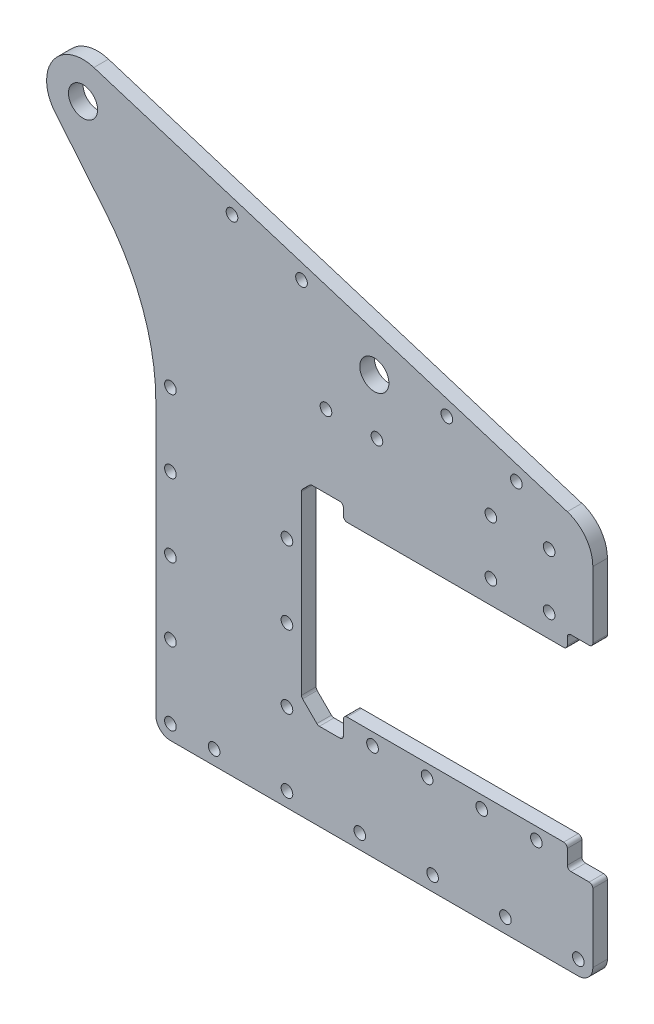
ISO-10303-21;
HEADER;
FILE_DESCRIPTION(('STEP AP214'),'2;1');
FILE_NAME('part.step','',(''),(''),'','','');
FILE_SCHEMA(('AUTOMOTIVE_DESIGN { 1 0 10303 214 1 1 1 1 }'));
ENDSEC;
DATA;
#1=APPLICATION_CONTEXT('core data for automotive mechanical design processes');
#2=APPLICATION_PROTOCOL_DEFINITION('international standard','automotive_design',2000,#1);
#3=PRODUCT_CONTEXT('',#1,'mechanical');
#4=PRODUCT('Part','Part','',(#3));
#5=PRODUCT_RELATED_PRODUCT_CATEGORY('part','',(#4));
#6=PRODUCT_DEFINITION_FORMATION('','',#4);
#7=PRODUCT_DEFINITION_CONTEXT('part definition',#1,'design');
#8=PRODUCT_DEFINITION('design','',#6,#7);
#9=PRODUCT_DEFINITION_SHAPE('','',#8);
#10=(LENGTH_UNIT() NAMED_UNIT(*) SI_UNIT(.MILLI.,.METRE.));
#11=(NAMED_UNIT(*) PLANE_ANGLE_UNIT() SI_UNIT($,.RADIAN.));
#12=(NAMED_UNIT(*) SI_UNIT($,.STERADIAN.) SOLID_ANGLE_UNIT());
#13=UNCERTAINTY_MEASURE_WITH_UNIT(LENGTH_MEASURE(1.E-05),#10,'distance_accuracy_value','');
#14=(GEOMETRIC_REPRESENTATION_CONTEXT(3) GLOBAL_UNCERTAINTY_ASSIGNED_CONTEXT((#13)) GLOBAL_UNIT_ASSIGNED_CONTEXT((#10,
#11,#12)) REPRESENTATION_CONTEXT('',''));
#15=CARTESIAN_POINT('',(0.,0.,0.));
#16=DIRECTION('',(0.,0.,1.));
#17=DIRECTION('',(1.,0.,0.));
#18=AXIS2_PLACEMENT_3D('',#15,#16,#17);
#19=CARTESIAN_POINT('',(80.,0.,4.));
#20=DIRECTION('',(0.,-1.,0.));
#21=DIRECTION('',(1.,0.,0.));
#22=AXIS2_PLACEMENT_3D('',#19,#20,#21);
#23=PLANE('',#22);
#24=DIRECTION('',(-1.,0.,0.));
#25=VECTOR('',#24,1.);
#26=CARTESIAN_POINT('',(80.,0.,0.));
#27=LINE('',#26,#25);
#28=CARTESIAN_POINT('',(72.,0.,0.));
#29=VERTEX_POINT('',#28);
#30=CARTESIAN_POINT('',(12.5,0.,0.));
#31=VERTEX_POINT('',#30);
#32=EDGE_CURVE('E390',#29,#31,#27,.T.);
#33=ORIENTED_EDGE('',*,*,#32,.T.);
#34=DIRECTION('',(0.,0.,1.));
#35=VECTOR('',#34,1.);
#36=CARTESIAN_POINT('',(12.5,0.,4.));
#37=LINE('',#36,#35);
#38=CARTESIAN_POINT('',(12.5,0.,4.));
#39=VERTEX_POINT('',#38);
#40=EDGE_CURVE('E541',#31,#39,#37,.T.);
#41=ORIENTED_EDGE('',*,*,#40,.T.);
#42=DIRECTION('',(-1.,0.,0.));
#43=VECTOR('',#42,1.);
#44=CARTESIAN_POINT('',(80.,0.,4.));
#45=LINE('',#44,#43);
#46=CARTESIAN_POINT('',(72.,0.,4.));
#47=VERTEX_POINT('',#46);
#48=EDGE_CURVE('E375',#47,#39,#45,.T.);
#49=ORIENTED_EDGE('',*,*,#48,.F.);
#50=DIRECTION('',(0.,0.,-1.));
#51=VECTOR('',#50,1.);
#52=CARTESIAN_POINT('',(72.,0.,4.));
#53=LINE('',#52,#51);
#54=EDGE_CURVE('E538',#47,#29,#53,.T.);
#55=ORIENTED_EDGE('',*,*,#54,.T.);
#56=EDGE_LOOP('',(#33,#41,#49,#55));
#57=FACE_BOUND('',#56,.T.);
#58=ADVANCED_FACE('F44',(#57),#23,.F.);
#59=CARTESIAN_POINT('',(0.,46.3,4.));
#60=DIRECTION('',(0.,1.,0.));
#61=DIRECTION('',(0.,0.,1.));
#62=AXIS2_PLACEMENT_3D('',#59,#60,#61);
#63=PLANE('',#62);
#64=DIRECTION('',(1.,0.,0.));
#65=VECTOR('',#64,1.);
#66=CARTESIAN_POINT('',(0.,46.3,0.));
#67=LINE('',#66,#65);
#68=CARTESIAN_POINT('',(12.5,46.3,0.));
#69=VERTEX_POINT('',#68);
#70=CARTESIAN_POINT('',(72.,46.3,0.));
#71=VERTEX_POINT('',#70);
#72=EDGE_CURVE('E369',#69,#71,#67,.T.);
#73=ORIENTED_EDGE('',*,*,#72,.T.);
#74=DIRECTION('',(0.,0.,1.));
#75=VECTOR('',#74,1.);
#76=CARTESIAN_POINT('',(72.,46.3,4.));
#77=LINE('',#76,#75);
#78=CARTESIAN_POINT('',(72.,46.3,4.));
#79=VERTEX_POINT('',#78);
#80=EDGE_CURVE('E501',#71,#79,#77,.T.);
#81=ORIENTED_EDGE('',*,*,#80,.T.);
#82=DIRECTION('',(1.,0.,0.));
#83=VECTOR('',#82,1.);
#84=CARTESIAN_POINT('',(0.,46.3,4.));
#85=LINE('',#84,#83);
#86=CARTESIAN_POINT('',(12.5,46.3,4.));
#87=VERTEX_POINT('',#86);
#88=EDGE_CURVE('E381',#87,#79,#85,.T.);
#89=ORIENTED_EDGE('',*,*,#88,.F.);
#90=DIRECTION('',(0.,0.,-1.));
#91=VECTOR('',#90,1.);
#92=CARTESIAN_POINT('',(12.5,46.3,4.));
#93=LINE('',#92,#91);
#94=EDGE_CURVE('E498',#87,#69,#93,.T.);
#95=ORIENTED_EDGE('',*,*,#94,.T.);
#96=EDGE_LOOP('',(#73,#81,#89,#95));
#97=FACE_BOUND('',#96,.T.);
#98=ADVANCED_FACE('F702',(#97),#63,.F.);
#99=CARTESIAN_POINT('',(80.,46.3,4.));
#100=DIRECTION('',(-1.,0.,0.));
#101=DIRECTION('',(0.,0.,1.));
#102=AXIS2_PLACEMENT_3D('',#99,#100,#101);
#103=PLANE('',#102);
#104=DIRECTION('',(0.,1.,0.));
#105=VECTOR('',#104,1.);
#106=CARTESIAN_POINT('',(80.,46.3,4.));
#107=LINE('',#106,#105);
#108=CARTESIAN_POINT('',(80.,51.3,4.));
#109=VERTEX_POINT('',#108);
#110=CARTESIAN_POINT('',(80.,69.525,4.));
#111=VERTEX_POINT('',#110);
#112=EDGE_CURVE('E366',#109,#111,#107,.T.);
#113=ORIENTED_EDGE('',*,*,#112,.F.);
#114=DIRECTION('',(0.,0.,-1.));
#115=VECTOR('',#114,1.);
#116=CARTESIAN_POINT('',(80.,51.3,4.));
#117=LINE('',#116,#115);
#118=CARTESIAN_POINT('',(80.,51.3,0.));
#119=VERTEX_POINT('',#118);
#120=EDGE_CURVE('E464',#109,#119,#117,.T.);
#121=ORIENTED_EDGE('',*,*,#120,.T.);
#122=DIRECTION('',(0.,1.,0.));
#123=VECTOR('',#122,1.);
#124=CARTESIAN_POINT('',(80.,46.3,0.));
#125=LINE('',#124,#123);
#126=CARTESIAN_POINT('',(80.,69.525,0.));
#127=VERTEX_POINT('',#126);
#128=EDGE_CURVE('E363',#119,#127,#125,.T.);
#129=ORIENTED_EDGE('',*,*,#128,.T.);
#130=DIRECTION('',(0.,0.,-1.));
#131=VECTOR('',#130,1.);
#132=CARTESIAN_POINT('',(80.,69.525,4.));
#133=LINE('',#132,#131);
#134=EDGE_CURVE('E302',#127,#111,#133,.F.);
#135=ORIENTED_EDGE('',*,*,#134,.T.);
#136=EDGE_LOOP('',(#113,#121,#129,#135));
#137=FACE_BOUND('',#136,.T.);
#138=ADVANCED_FACE('F725',(#137),#103,.F.);
#139=CARTESIAN_POINT('',(-70.,-29.85,4.));
#140=DIRECTION('',(0.,1.,0.));
#141=DIRECTION('',(-1.,0.,0.));
#142=AXIS2_PLACEMENT_3D('',#139,#140,#141);
#143=PLANE('',#142);
#144=DIRECTION('',(1.,0.,0.));
#145=VECTOR('',#144,1.);
#146=CARTESIAN_POINT('',(-70.,-29.85,4.));
#147=LINE('',#146,#145);
#148=CARTESIAN_POINT('',(-36.,-29.85,4.));
#149=VERTEX_POINT('',#148);
#150=CARTESIAN_POINT('',(76.,-29.85,4.));
#151=VERTEX_POINT('',#150);
#152=EDGE_CURVE('E368',#149,#151,#147,.T.);
#153=ORIENTED_EDGE('',*,*,#152,.F.);
#154=DIRECTION('',(0.,0.,1.));
#155=VECTOR('',#154,1.);
#156=CARTESIAN_POINT('',(-36.,-29.85,4.));
#157=LINE('',#156,#155);
#158=CARTESIAN_POINT('',(-36.,-29.85,0.));
#159=VERTEX_POINT('',#158);
#160=EDGE_CURVE('E455',#149,#159,#157,.F.);
#161=ORIENTED_EDGE('',*,*,#160,.T.);
#162=DIRECTION('',(1.,0.,0.));
#163=VECTOR('',#162,1.);
#164=CARTESIAN_POINT('',(-70.,-29.85,0.));
#165=LINE('',#164,#163);
#166=CARTESIAN_POINT('',(76.,-29.85,0.));
#167=VERTEX_POINT('',#166);
#168=EDGE_CURVE('E384',#159,#167,#165,.T.);
#169=ORIENTED_EDGE('',*,*,#168,.T.);
#170=DIRECTION('',(0.,0.,-1.));
#171=VECTOR('',#170,1.);
#172=CARTESIAN_POINT('',(76.,-29.85,4.));
#173=LINE('',#172,#171);
#174=EDGE_CURVE('E453',#167,#151,#173,.F.);
#175=ORIENTED_EDGE('',*,*,#174,.T.);
#176=EDGE_LOOP('',(#153,#161,#169,#175));
#177=FACE_BOUND('',#176,.T.);
#178=ADVANCED_FACE('F832',(#177),#143,.F.);
#179=CARTESIAN_POINT('',(80.,-29.85,4.));
#180=DIRECTION('',(-1.,0.,0.));
#181=DIRECTION('',(0.,-1.,0.));
#182=AXIS2_PLACEMENT_3D('',#179,#180,#181);
#183=PLANE('',#182);
#184=DIRECTION('',(0.,1.,0.));
#185=VECTOR('',#184,1.);
#186=CARTESIAN_POINT('',(80.,-29.85,0.));
#187=LINE('',#186,#185);
#188=CARTESIAN_POINT('',(80.,-25.85,0.));
#189=VERTEX_POINT('',#188);
#190=CARTESIAN_POINT('',(80.,-7.00000000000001,0.));
#191=VERTEX_POINT('',#190);
#192=EDGE_CURVE('E387',#189,#191,#187,.T.);
#193=ORIENTED_EDGE('',*,*,#192,.T.);
#194=DIRECTION('',(0.,0.,-1.));
#195=VECTOR('',#194,1.);
#196=CARTESIAN_POINT('',(80.,-7.00000000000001,4.));
#197=LINE('',#196,#195);
#198=CARTESIAN_POINT('',(80.,-7.00000000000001,4.));
#199=VERTEX_POINT('',#198);
#200=EDGE_CURVE('E554',#191,#199,#197,.F.);
#201=ORIENTED_EDGE('',*,*,#200,.T.);
#202=DIRECTION('',(0.,1.,0.));
#203=VECTOR('',#202,1.);
#204=CARTESIAN_POINT('',(80.,-29.85,4.));
#205=LINE('',#204,#203);
#206=CARTESIAN_POINT('',(80.,-25.85,4.));
#207=VERTEX_POINT('',#206);
#208=EDGE_CURVE('E372',#207,#199,#205,.T.);
#209=ORIENTED_EDGE('',*,*,#208,.F.);
#210=DIRECTION('',(0.,0.,-1.));
#211=VECTOR('',#210,1.);
#212=CARTESIAN_POINT('',(80.,-25.85,4.));
#213=LINE('',#212,#211);
#214=EDGE_CURVE('E461',#207,#189,#213,.T.);
#215=ORIENTED_EDGE('',*,*,#214,.T.);
#216=EDGE_LOOP('',(#193,#201,#209,#215));
#217=FACE_BOUND('',#216,.T.);
#218=ADVANCED_FACE('F829',(#217),#183,.F.);
#219=CARTESIAN_POINT('',(0.,0.,4.));
#220=DIRECTION('',(-1.,0.,0.));
#221=DIRECTION('',(0.,0.,1.));
#222=AXIS2_PLACEMENT_3D('',#219,#220,#221);
#223=PLANE('',#222);
#224=DIRECTION('',(0.,1.,0.));
#225=VECTOR('',#224,1.);
#226=CARTESIAN_POINT('',(0.,0.,0.));
#227=LINE('',#226,#225);
#228=CARTESIAN_POINT('',(0.,-1.085786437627,0.));
#229=VERTEX_POINT('',#228);
#230=CARTESIAN_POINT('',(0.,47.385786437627,0.));
#231=VERTEX_POINT('',#230);
#232=EDGE_CURVE('E393',#229,#231,#227,.T.);
#233=ORIENTED_EDGE('',*,*,#232,.T.);
#234=DIRECTION('',(0.,0.,-1.));
#235=VECTOR('',#234,1.);
#236=CARTESIAN_POINT('',(0.,47.385786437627,4.));
#237=LINE('',#236,#235);
#238=CARTESIAN_POINT('',(0.,47.385786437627,4.));
#239=VERTEX_POINT('',#238);
#240=EDGE_CURVE('E521',#231,#239,#237,.F.);
#241=ORIENTED_EDGE('',*,*,#240,.T.);
#242=DIRECTION('',(0.,1.,0.));
#243=VECTOR('',#242,1.);
#244=CARTESIAN_POINT('',(0.,0.,4.));
#245=LINE('',#244,#243);
#246=CARTESIAN_POINT('',(0.,-1.085786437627,4.));
#247=VERTEX_POINT('',#246);
#248=EDGE_CURVE('E378',#247,#239,#245,.T.);
#249=ORIENTED_EDGE('',*,*,#248,.F.);
#250=DIRECTION('',(0.,0.,1.));
#251=VECTOR('',#250,1.);
#252=CARTESIAN_POINT('',(0.,-1.085786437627,4.));
#253=LINE('',#252,#251);
#254=EDGE_CURVE('E518',#247,#229,#253,.F.);
#255=ORIENTED_EDGE('',*,*,#254,.T.);
#256=EDGE_LOOP('',(#233,#241,#249,#255));
#257=FACE_BOUND('',#256,.T.);
#258=ADVANCED_FACE('F669',(#257),#223,.F.);
#259=CARTESIAN_POINT('',(0.,0.,4.));
#260=DIRECTION('',(0.,0.,1.));
#261=DIRECTION('',(1.,0.,0.));
#262=AXIS2_PLACEMENT_3D('',#259,#260,#261);
#263=PLANE('',#262);
#264=DIRECTION('',(1.,0.,0.));
#265=VECTOR('',#264,1.);
#266=CARTESIAN_POINT('',(80.,50.3,4.));
#267=LINE('',#266,#265);
#268=CARTESIAN_POINT('',(74.,50.3,4.));
#269=VERTEX_POINT('',#268);
#270=CARTESIAN_POINT('',(79.,50.3,4.));
#271=VERTEX_POINT('',#270);
#272=EDGE_CURVE('E321',#269,#271,#267,.T.);
#273=ORIENTED_EDGE('',*,*,#272,.T.);
#274=CARTESIAN_POINT('',(79.,51.3,4.));
#275=DIRECTION('',(0.,0.,1.));
#276=DIRECTION('',(1.,0.,0.));
#277=AXIS2_PLACEMENT_3D('',#274,#275,#276);
#278=CIRCLE('',#277,1.);
#279=EDGE_CURVE('E493',#271,#109,#278,.T.);
#280=ORIENTED_EDGE('',*,*,#279,.T.);
#281=ORIENTED_EDGE('',*,*,#112,.T.);
#282=CARTESIAN_POINT('',(70.,69.525,4.));
#283=DIRECTION('',(0.,0.,1.));
#284=DIRECTION('',(1.,0.,0.));
#285=AXIS2_PLACEMENT_3D('',#282,#283,#284);
#286=CIRCLE('',#285,10.);
#287=CARTESIAN_POINT('',(72.9827499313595,79.0697997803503,4.));
#288=VERTEX_POINT('',#287);
#289=EDGE_CURVE('E404',#111,#288,#286,.T.);
#290=ORIENTED_EDGE('',*,*,#289,.T.);
#291=DIRECTION('',(-0.95447997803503,0.298274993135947,0.));
#292=VECTOR('',#291,1.);
#293=CARTESIAN_POINT('',(80.,76.8769091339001,4.));
#294=LINE('',#293,#292);
#295=CARTESIAN_POINT('',(-57.0172500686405,119.69479978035,4.));
#296=VERTEX_POINT('',#295);
#297=EDGE_CURVE('E315',#288,#296,#294,.T.);
#298=ORIENTED_EDGE('',*,*,#297,.T.);
#299=CARTESIAN_POINT('',(-60.,110.15,4.));
#300=DIRECTION('',(0.,0.,1.));
#301=DIRECTION('',(1.,0.,0.));
#302=AXIS2_PLACEMENT_3D('',#299,#300,#301);
#303=CIRCLE('',#302,10.);
#304=CARTESIAN_POINT('',(-70.,110.15,4.));
#305=VERTEX_POINT('',#304);
#306=EDGE_CURVE('E401',#296,#305,#303,.T.);
#307=ORIENTED_EDGE('',*,*,#306,.T.);
#308=CARTESIAN_POINT('',(-60.,110.15,4.));
#309=DIRECTION('',(0.,0.,1.));
#310=DIRECTION('',(1.,0.,0.));
#311=AXIS2_PLACEMENT_3D('',#308,#309,#310);
#312=CIRCLE('',#311,10.);
#313=CARTESIAN_POINT('',(-67.7177978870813,103.791101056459,4.));
#314=VERTEX_POINT('',#313);
#315=EDGE_CURVE('E415',#305,#314,#312,.T.);
#316=ORIENTED_EDGE('',*,*,#315,.T.);
#317=DIRECTION('',(-0.635889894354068,0.771779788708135,0.));
#318=VECTOR('',#317,1.);
#319=CARTESIAN_POINT('',(-70.,106.561010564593,4.));
#320=LINE('',#319,#318);
#321=CARTESIAN_POINT('',(-53.6932126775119,86.7694570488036,4.));
#322=VERTEX_POINT('',#321);
#323=EDGE_CURVE('E735',#322,#314,#320,.T.);
#324=ORIENTED_EDGE('',*,*,#323,.F.);
#325=CARTESIAN_POINT('',(-100.,48.6160633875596,4.));
#326=DIRECTION('',(0.,0.,1.));
#327=DIRECTION('',(1.,0.,0.));
#328=AXIS2_PLACEMENT_3D('',#325,#326,#327);
#329=CIRCLE('',#328,60.);
#330=CARTESIAN_POINT('',(-40.,48.6160633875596,4.));
#331=VERTEX_POINT('',#330);
#332=EDGE_CURVE('E429',#322,#331,#329,.F.);
#333=ORIENTED_EDGE('',*,*,#332,.T.);
#334=DIRECTION('',(0.,1.,0.));
#335=VECTOR('',#334,1.);
#336=CARTESIAN_POINT('',(-40.,70.15,4.));
#337=LINE('',#336,#335);
#338=CARTESIAN_POINT('',(-40.,-25.85,4.));
#339=VERTEX_POINT('',#338);
#340=EDGE_CURVE('E740',#339,#331,#337,.T.);
#341=ORIENTED_EDGE('',*,*,#340,.F.);
#342=CARTESIAN_POINT('',(-36.,-25.85,4.));
#343=DIRECTION('',(0.,0.,1.));
#344=DIRECTION('',(1.,0.,0.));
#345=AXIS2_PLACEMENT_3D('',#342,#343,#344);
#346=CIRCLE('',#345,4.);
#347=EDGE_CURVE('E451',#339,#149,#346,.T.);
#348=ORIENTED_EDGE('',*,*,#347,.T.);
#349=ORIENTED_EDGE('',*,*,#152,.T.);
#350=CARTESIAN_POINT('',(76.,-25.85,4.));
#351=DIRECTION('',(0.,0.,1.));
#352=DIRECTION('',(1.,0.,0.));
#353=AXIS2_PLACEMENT_3D('',#350,#351,#352);
#354=CIRCLE('',#353,4.);
#355=EDGE_CURVE('E449',#151,#207,#354,.T.);
#356=ORIENTED_EDGE('',*,*,#355,.T.);
#357=ORIENTED_EDGE('',*,*,#208,.T.);
#358=CARTESIAN_POINT('',(79.,-7.00000000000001,4.));
#359=DIRECTION('',(0.,0.,1.));
#360=DIRECTION('',(1.,0.,0.));
#361=AXIS2_PLACEMENT_3D('',#358,#359,#360);
#362=CIRCLE('',#361,1.);
#363=CARTESIAN_POINT('',(79.,-6.00000000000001,4.));
#364=VERTEX_POINT('',#363);
#365=EDGE_CURVE('E484',#199,#364,#362,.T.);
#366=ORIENTED_EDGE('',*,*,#365,.T.);
#367=DIRECTION('',(-1.,0.,0.));
#368=VECTOR('',#367,1.);
#369=CARTESIAN_POINT('',(80.,-6.00000000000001,4.));
#370=LINE('',#369,#368);
#371=CARTESIAN_POINT('',(74.,-6.00000000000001,4.));
#372=VERTEX_POINT('',#371);
#373=EDGE_CURVE('E606',#364,#372,#370,.T.);
#374=ORIENTED_EDGE('',*,*,#373,.T.);
#375=CARTESIAN_POINT('',(74.,-5.,4.));
#376=DIRECTION('',(0.,0.,1.));
#377=DIRECTION('',(1.,0.,0.));
#378=AXIS2_PLACEMENT_3D('',#375,#376,#377);
#379=CIRCLE('',#378,1.);
#380=CARTESIAN_POINT('',(73.,-5.,4.));
#381=VERTEX_POINT('',#380);
#382=EDGE_CURVE('E11',#372,#381,#379,.F.);
#383=ORIENTED_EDGE('',*,*,#382,.T.);
#384=DIRECTION('',(0.,1.,0.));
#385=VECTOR('',#384,1.);
#386=CARTESIAN_POINT('',(73.,50.3,4.));
#387=LINE('',#386,#385);
#388=CARTESIAN_POINT('',(73.,-1.,4.));
#389=VERTEX_POINT('',#388);
#390=EDGE_CURVE('E326',#381,#389,#387,.T.);
#391=ORIENTED_EDGE('',*,*,#390,.T.);
#392=CARTESIAN_POINT('',(72.,-1.,4.));
#393=DIRECTION('',(0.,0.,1.));
#394=DIRECTION('',(1.,0.,0.));
#395=AXIS2_PLACEMENT_3D('',#392,#393,#394);
#396=CIRCLE('',#395,1.);
#397=EDGE_CURVE('E486',#389,#47,#396,.T.);
#398=ORIENTED_EDGE('',*,*,#397,.T.);
#399=ORIENTED_EDGE('',*,*,#48,.T.);
#400=CARTESIAN_POINT('',(12.5,-1.,4.));
#401=DIRECTION('',(0.,0.,1.));
#402=DIRECTION('',(1.,0.,0.));
#403=AXIS2_PLACEMENT_3D('',#400,#401,#402);
#404=CIRCLE('',#403,1.);
#405=CARTESIAN_POINT('',(11.5,-1.,4.));
#406=VERTEX_POINT('',#405);
#407=EDGE_CURVE('E488',#39,#406,#404,.T.);
#408=ORIENTED_EDGE('',*,*,#407,.T.);
#409=DIRECTION('',(0.,-1.,0.));
#410=VECTOR('',#409,1.);
#411=CARTESIAN_POINT('',(11.5,50.3,4.));
#412=LINE('',#411,#410);
#413=CARTESIAN_POINT('',(11.5,-5.,4.));
#414=VERTEX_POINT('',#413);
#415=EDGE_CURVE('E634',#406,#414,#412,.T.);
#416=ORIENTED_EDGE('',*,*,#415,.T.);
#417=CARTESIAN_POINT('',(10.5,-5.,4.));
#418=DIRECTION('',(0.,0.,1.));
#419=DIRECTION('',(1.,0.,0.));
#420=AXIS2_PLACEMENT_3D('',#417,#418,#419);
#421=CIRCLE('',#420,1.);
#422=CARTESIAN_POINT('',(10.5,-6.,4.));
#423=VERTEX_POINT('',#422);
#424=EDGE_CURVE('E582',#414,#423,#421,.F.);
#425=ORIENTED_EDGE('',*,*,#424,.T.);
#426=DIRECTION('',(-1.,0.,0.));
#427=VECTOR('',#426,1.);
#428=CARTESIAN_POINT('',(11.5,-6.,4.));
#429=LINE('',#428,#427);
#430=CARTESIAN_POINT('',(4.91421356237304,-6.00000000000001,4.));
#431=VERTEX_POINT('',#430);
#432=EDGE_CURVE('E631',#423,#431,#429,.T.);
#433=ORIENTED_EDGE('',*,*,#432,.T.);
#434=CARTESIAN_POINT('',(4.91421356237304,-5.00000000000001,4.));
#435=DIRECTION('',(0.,0.,1.));
#436=DIRECTION('',(1.,0.,0.));
#437=AXIS2_PLACEMENT_3D('',#434,#435,#436);
#438=CIRCLE('',#437,1.);
#439=CARTESIAN_POINT('',(4.2071067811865,-5.70710678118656,4.));
#440=VERTEX_POINT('',#439);
#441=EDGE_CURVE('E578',#431,#440,#438,.F.);
#442=ORIENTED_EDGE('',*,*,#441,.T.);
#443=DIRECTION('',(0.707106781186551,-0.707106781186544,0.));
#444=VECTOR('',#443,1.);
#445=CARTESIAN_POINT('',(-0.750000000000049,-0.750000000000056,4.));
#446=LINE('',#445,#444);
#447=CARTESIAN_POINT('',(0.292893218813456,-1.79289321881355,4.));
#448=VERTEX_POINT('',#447);
#449=EDGE_CURVE('E443',#440,#448,#446,.F.);
#450=ORIENTED_EDGE('',*,*,#449,.T.);
#451=CARTESIAN_POINT('',(1.,-1.085786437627,4.));
#452=DIRECTION('',(0.,0.,1.));
#453=DIRECTION('',(1.,0.,0.));
#454=AXIS2_PLACEMENT_3D('',#451,#452,#453);
#455=CIRCLE('',#454,1.);
#456=EDGE_CURVE('E574',#448,#247,#455,.F.);
#457=ORIENTED_EDGE('',*,*,#456,.T.);
#458=ORIENTED_EDGE('',*,*,#248,.T.);
#459=CARTESIAN_POINT('',(1.,47.385786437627,4.));
#460=DIRECTION('',(0.,0.,1.));
#461=DIRECTION('',(1.,0.,0.));
#462=AXIS2_PLACEMENT_3D('',#459,#460,#461);
#463=CIRCLE('',#462,1.);
#464=CARTESIAN_POINT('',(0.292893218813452,48.0928932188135,4.));
#465=VERTEX_POINT('',#464);
#466=EDGE_CURVE('E568',#239,#465,#463,.F.);
#467=ORIENTED_EDGE('',*,*,#466,.T.);
#468=DIRECTION('',(-0.707106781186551,-0.707106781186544,0.));
#469=VECTOR('',#468,1.);
#470=CARTESIAN_POINT('',(-23.9,23.9000000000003,4.));
#471=LINE('',#470,#469);
#472=CARTESIAN_POINT('',(2.20710678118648,50.0071067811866,4.));
#473=VERTEX_POINT('',#472);
#474=EDGE_CURVE('E440',#465,#473,#471,.F.);
#475=ORIENTED_EDGE('',*,*,#474,.T.);
#476=CARTESIAN_POINT('',(2.91421356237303,49.3,4.));
#477=DIRECTION('',(0.,0.,1.));
#478=DIRECTION('',(1.,0.,0.));
#479=AXIS2_PLACEMENT_3D('',#476,#477,#478);
#480=CIRCLE('',#479,1.);
#481=CARTESIAN_POINT('',(2.91421356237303,50.3,4.));
#482=VERTEX_POINT('',#481);
#483=EDGE_CURVE('E566',#473,#482,#480,.F.);
#484=ORIENTED_EDGE('',*,*,#483,.T.);
#485=DIRECTION('',(1.,0.,0.));
#486=VECTOR('',#485,1.);
#487=CARTESIAN_POINT('',(11.5,50.3,4.));
#488=LINE('',#487,#486);
#489=CARTESIAN_POINT('',(10.5,50.3,4.));
#490=VERTEX_POINT('',#489);
#491=EDGE_CURVE('E628',#482,#490,#488,.T.);
#492=ORIENTED_EDGE('',*,*,#491,.T.);
#493=CARTESIAN_POINT('',(10.5,49.3,4.));
#494=DIRECTION('',(0.,0.,1.));
#495=DIRECTION('',(1.,0.,0.));
#496=AXIS2_PLACEMENT_3D('',#493,#494,#495);
#497=CIRCLE('',#496,1.);
#498=CARTESIAN_POINT('',(11.5,49.3,4.));
#499=VERTEX_POINT('',#498);
#500=EDGE_CURVE('E562',#490,#499,#497,.F.);
#501=ORIENTED_EDGE('',*,*,#500,.T.);
#502=CARTESIAN_POINT('',(11.5,47.3,4.));
#503=VERTEX_POINT('',#502);
#504=EDGE_CURVE('E623',#499,#503,#412,.T.);
#505=ORIENTED_EDGE('',*,*,#504,.T.);
#506=CARTESIAN_POINT('',(12.5,47.3,4.));
#507=DIRECTION('',(0.,0.,1.));
#508=DIRECTION('',(1.,0.,0.));
#509=AXIS2_PLACEMENT_3D('',#506,#507,#508);
#510=CIRCLE('',#509,1.);
#511=EDGE_CURVE('E490',#503,#87,#510,.T.);
#512=ORIENTED_EDGE('',*,*,#511,.T.);
#513=ORIENTED_EDGE('',*,*,#88,.T.);
#514=CARTESIAN_POINT('',(72.,47.3,4.));
#515=DIRECTION('',(0.,0.,1.));
#516=DIRECTION('',(1.,0.,0.));
#517=AXIS2_PLACEMENT_3D('',#514,#515,#516);
#518=CIRCLE('',#517,1.);
#519=CARTESIAN_POINT('',(73.,47.3,4.));
#520=VERTEX_POINT('',#519);
#521=EDGE_CURVE('E66',#79,#520,#518,.T.);
#522=ORIENTED_EDGE('',*,*,#521,.T.);
#523=CARTESIAN_POINT('',(73.,49.3,4.));
#524=VERTEX_POINT('',#523);
#525=EDGE_CURVE('E610',#520,#524,#387,.T.);
#526=ORIENTED_EDGE('',*,*,#525,.T.);
#527=CARTESIAN_POINT('',(74.,49.3,4.));
#528=DIRECTION('',(0.,0.,1.));
#529=DIRECTION('',(1.,0.,0.));
#530=AXIS2_PLACEMENT_3D('',#527,#528,#529);
#531=CIRCLE('',#530,1.);
#532=EDGE_CURVE('E558',#524,#269,#531,.F.);
#533=ORIENTED_EDGE('',*,*,#532,.T.);
#534=EDGE_LOOP('',(#273,#280,#281,#290,#298,#307,#316,#324,#333,#341,#348,#349,#356,#357,#366,
#374,#383,#391,#398,#399,#408,#416,#425,#433,#442,#450,#457,#458,#467,#475,#484,#492,#501,#505,
#512,#513,#522,#526,#533));
#535=FACE_BOUND('',#534,.T.);
#536=CARTESIAN_POINT('',(-4.00000000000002,-25.85,4.));
#537=DIRECTION('',(0.,0.,-1.));
#538=DIRECTION('',(-1.,0.,0.));
#539=AXIS2_PLACEMENT_3D('',#536,#537,#538);
#540=CIRCLE('',#539,1.6);
#541=CARTESIAN_POINT('',(-5.60000000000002,-25.85,4.));
#542=VERTEX_POINT('',#541);
#543=EDGE_CURVE('E976',#542,#542,#540,.T.);
#544=ORIENTED_EDGE('',*,*,#543,.T.);
#545=EDGE_LOOP('',(#544));
#546=FACE_BOUND('',#545,.T.);
#547=CARTESIAN_POINT('',(16.,-25.85,4.));
#548=DIRECTION('',(0.,0.,-1.));
#549=DIRECTION('',(-1.,0.,0.));
#550=AXIS2_PLACEMENT_3D('',#547,#548,#549);
#551=CIRCLE('',#550,1.6);
#552=CARTESIAN_POINT('',(14.4,-25.85,4.));
#553=VERTEX_POINT('',#552);
#554=EDGE_CURVE('E983',#553,#553,#551,.T.);
#555=ORIENTED_EDGE('',*,*,#554,.T.);
#556=EDGE_LOOP('',(#555));
#557=FACE_BOUND('',#556,.T.);
#558=CARTESIAN_POINT('',(36.,-25.85,4.));
#559=DIRECTION('',(0.,0.,-1.));
#560=DIRECTION('',(-1.,0.,0.));
#561=AXIS2_PLACEMENT_3D('',#558,#559,#560);
#562=CIRCLE('',#561,1.6);
#563=CARTESIAN_POINT('',(34.4,-25.85,4.));
#564=VERTEX_POINT('',#563);
#565=EDGE_CURVE('E989',#564,#564,#562,.T.);
#566=ORIENTED_EDGE('',*,*,#565,.T.);
#567=EDGE_LOOP('',(#566));
#568=FACE_BOUND('',#567,.T.);
#569=CARTESIAN_POINT('',(56.,-25.85,4.));
#570=DIRECTION('',(0.,0.,-1.));
#571=DIRECTION('',(-1.,0.,0.));
#572=AXIS2_PLACEMENT_3D('',#569,#570,#571);
#573=CIRCLE('',#572,1.6);
#574=CARTESIAN_POINT('',(54.4,-25.85,4.));
#575=VERTEX_POINT('',#574);
#576=EDGE_CURVE('E995',#575,#575,#573,.T.);
#577=ORIENTED_EDGE('',*,*,#576,.T.);
#578=EDGE_LOOP('',(#577));
#579=FACE_BOUND('',#578,.T.);
#580=CARTESIAN_POINT('',(-35.9999999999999,-5.85000000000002,4.));
#581=DIRECTION('',(0.,0.,-1.));
#582=DIRECTION('',(-1.,0.,0.));
#583=AXIS2_PLACEMENT_3D('',#580,#581,#582);
#584=CIRCLE('',#583,1.6);
#585=CARTESIAN_POINT('',(-37.5999999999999,-5.85000000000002,4.));
#586=VERTEX_POINT('',#585);
#587=EDGE_CURVE('E959',#586,#586,#584,.T.);
#588=ORIENTED_EDGE('',*,*,#587,.T.);
#589=EDGE_LOOP('',(#588));
#590=FACE_BOUND('',#589,.T.);
#591=CARTESIAN_POINT('',(-35.9999999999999,14.15,4.));
#592=DIRECTION('',(0.,0.,-1.));
#593=DIRECTION('',(-1.,0.,0.));
#594=AXIS2_PLACEMENT_3D('',#591,#592,#593);
#595=CIRCLE('',#594,1.6);
#596=CARTESIAN_POINT('',(-37.5999999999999,14.15,4.));
#597=VERTEX_POINT('',#596);
#598=EDGE_CURVE('E952',#597,#597,#595,.T.);
#599=ORIENTED_EDGE('',*,*,#598,.T.);
#600=EDGE_LOOP('',(#599));
#601=FACE_BOUND('',#600,.T.);
#602=CARTESIAN_POINT('',(-35.9999999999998,34.15,4.));
#603=DIRECTION('',(0.,0.,-1.));
#604=DIRECTION('',(-1.,0.,0.));
#605=AXIS2_PLACEMENT_3D('',#602,#603,#604);
#606=CIRCLE('',#605,1.6);
#607=CARTESIAN_POINT('',(-37.5999999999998,34.15,4.));
#608=VERTEX_POINT('',#607);
#609=EDGE_CURVE('E971',#608,#608,#606,.T.);
#610=ORIENTED_EDGE('',*,*,#609,.T.);
#611=EDGE_LOOP('',(#610));
#612=FACE_BOUND('',#611,.T.);
#613=CARTESIAN_POINT('',(76.,-25.85,4.));
#614=DIRECTION('',(0.,0.,-1.));
#615=DIRECTION('',(-1.,0.,0.));
#616=AXIS2_PLACEMENT_3D('',#613,#614,#615);
#617=CIRCLE('',#616,1.6);
#618=CARTESIAN_POINT('',(74.4,-25.85,4.));
#619=VERTEX_POINT('',#618);
#620=EDGE_CURVE('E964',#619,#619,#617,.T.);
#621=ORIENTED_EDGE('',*,*,#620,.T.);
#622=EDGE_LOOP('',(#621));
#623=FACE_BOUND('',#622,.T.);
#624=CARTESIAN_POINT('',(-24.,-25.85,4.));
#625=DIRECTION('',(0.,0.,-1.));
#626=DIRECTION('',(-1.,0.,0.));
#627=AXIS2_PLACEMENT_3D('',#624,#625,#626);
#628=CIRCLE('',#627,1.6);
#629=CARTESIAN_POINT('',(-25.6,-25.85,4.));
#630=VERTEX_POINT('',#629);
#631=EDGE_CURVE('E1006',#630,#630,#628,.T.);
#632=ORIENTED_EDGE('',*,*,#631,.T.);
#633=EDGE_LOOP('',(#632));
#634=FACE_BOUND('',#633,.T.);
#635=CARTESIAN_POINT('',(-3.99999999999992,34.1499999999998,4.));
#636=DIRECTION('',(0.,0.,-1.));
#637=DIRECTION('',(-1.,0.,0.));
#638=AXIS2_PLACEMENT_3D('',#635,#636,#637);
#639=CIRCLE('',#638,1.6);
#640=CARTESIAN_POINT('',(-5.59999999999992,34.1499999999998,4.));
#641=VERTEX_POINT('',#640);
#642=EDGE_CURVE('E1024',#641,#641,#639,.T.);
#643=ORIENTED_EDGE('',*,*,#642,.T.);
#644=EDGE_LOOP('',(#643));
#645=FACE_BOUND('',#644,.T.);
#646=CARTESIAN_POINT('',(-4.,14.1499999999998,4.));
#647=DIRECTION('',(0.,0.,-1.));
#648=DIRECTION('',(-1.,0.,0.));
#649=AXIS2_PLACEMENT_3D('',#646,#647,#648);
#650=CIRCLE('',#649,1.6);
#651=CARTESIAN_POINT('',(-5.6,14.1499999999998,4.));
#652=VERTEX_POINT('',#651);
#653=EDGE_CURVE('E1007',#652,#652,#650,.T.);
#654=ORIENTED_EDGE('',*,*,#653,.T.);
#655=EDGE_LOOP('',(#654));
#656=FACE_BOUND('',#655,.T.);
#657=CARTESIAN_POINT('',(-4.00000000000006,-5.85000000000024,4.));
#658=DIRECTION('',(0.,0.,-1.));
#659=DIRECTION('',(-1.,0.,0.));
#660=AXIS2_PLACEMENT_3D('',#657,#658,#659);
#661=CIRCLE('',#660,1.6);
#662=CARTESIAN_POINT('',(-5.60000000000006,-5.85000000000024,4.));
#663=VERTEX_POINT('',#662);
#664=EDGE_CURVE('E1014',#663,#663,#661,.T.);
#665=ORIENTED_EDGE('',*,*,#664,.T.);
#666=EDGE_LOOP('',(#665));
#667=FACE_BOUND('',#666,.T.);
#668=CARTESIAN_POINT('',(-35.9999999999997,54.15,4.));
#669=DIRECTION('',(0.,0.,-1.));
#670=DIRECTION('',(-1.,0.,0.));
#671=AXIS2_PLACEMENT_3D('',#668,#669,#670);
#672=CIRCLE('',#671,1.6);
#673=CARTESIAN_POINT('',(-37.5999999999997,54.15,4.));
#674=VERTEX_POINT('',#673);
#675=EDGE_CURVE('E1000',#674,#674,#672,.T.);
#676=ORIENTED_EDGE('',*,*,#675,.T.);
#677=EDGE_LOOP('',(#676));
#678=FACE_BOUND('',#677,.T.);
#679=CARTESIAN_POINT('',(-36.,-25.85,4.));
#680=DIRECTION('',(0.,0.,-1.));
#681=DIRECTION('',(-1.,0.,0.));
#682=AXIS2_PLACEMENT_3D('',#679,#680,#681);
#683=CIRCLE('',#682,1.6);
#684=CARTESIAN_POINT('',(-37.6,-25.85,4.));
#685=VERTEX_POINT('',#684);
#686=EDGE_CURVE('E926',#685,#685,#683,.T.);
#687=ORIENTED_EDGE('',*,*,#686,.T.);
#688=EDGE_LOOP('',(#687));
#689=FACE_BOUND('',#688,.T.);
#690=CARTESIAN_POINT('',(64.5,-3.35,4.));
#691=DIRECTION('',(0.,0.,-1.));
#692=DIRECTION('',(-1.,0.,0.));
#693=AXIS2_PLACEMENT_3D('',#690,#691,#692);
#694=CIRCLE('',#693,1.60000000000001);
#695=CARTESIAN_POINT('',(62.9,-3.35,4.));
#696=VERTEX_POINT('',#695);
#697=EDGE_CURVE('E744',#696,#696,#694,.T.);
#698=ORIENTED_EDGE('',*,*,#697,.T.);
#699=EDGE_LOOP('',(#698));
#700=FACE_BOUND('',#699,.T.);
#701=CARTESIAN_POINT('',(49.5,-3.35,4.));
#702=DIRECTION('',(0.,0.,-1.));
#703=DIRECTION('',(-1.,0.,0.));
#704=AXIS2_PLACEMENT_3D('',#701,#702,#703);
#705=CIRCLE('',#704,1.6);
#706=CARTESIAN_POINT('',(47.9,-3.35,4.));
#707=VERTEX_POINT('',#706);
#708=EDGE_CURVE('E935',#707,#707,#705,.T.);
#709=ORIENTED_EDGE('',*,*,#708,.T.);
#710=EDGE_LOOP('',(#709));
#711=FACE_BOUND('',#710,.T.);
#712=CARTESIAN_POINT('',(34.5,-3.35,4.));
#713=DIRECTION('',(0.,0.,-1.));
#714=DIRECTION('',(-1.,0.,0.));
#715=AXIS2_PLACEMENT_3D('',#712,#713,#714);
#716=CIRCLE('',#715,1.60000000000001);
#717=CARTESIAN_POINT('',(32.9,-3.35,4.));
#718=VERTEX_POINT('',#717);
#719=EDGE_CURVE('E929',#718,#718,#716,.T.);
#720=ORIENTED_EDGE('',*,*,#719,.T.);
#721=EDGE_LOOP('',(#720));
#722=FACE_BOUND('',#721,.T.);
#723=CARTESIAN_POINT('',(19.5,-3.35,4.));
#724=DIRECTION('',(0.,0.,-1.));
#725=DIRECTION('',(-1.,0.,0.));
#726=AXIS2_PLACEMENT_3D('',#723,#724,#725);
#727=CIRCLE('',#726,1.6);
#728=CARTESIAN_POINT('',(17.9,-3.35,4.));
#729=VERTEX_POINT('',#728);
#730=EDGE_CURVE('E922',#729,#729,#727,.T.);
#731=ORIENTED_EDGE('',*,*,#730,.T.);
#732=EDGE_LOOP('',(#731));
#733=FACE_BOUND('',#732,.T.);
#734=CARTESIAN_POINT('',(-19.0895995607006,103.651645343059,4.));
#735=DIRECTION('',(0.,0.,1.));
#736=DIRECTION('',(1.,0.,0.));
#737=AXIS2_PLACEMENT_3D('',#734,#735,#736);
#738=CIRCLE('',#737,1.60000000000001);
#739=CARTESIAN_POINT('',(-17.4895995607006,103.651645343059,4.));
#740=VERTEX_POINT('',#739);
#741=EDGE_CURVE('E752',#740,#740,#738,.T.);
#742=ORIENTED_EDGE('',*,*,#741,.F.);
#743=EDGE_LOOP('',(#742));
#744=FACE_BOUND('',#743,.T.);
#745=CARTESIAN_POINT('',(0.,97.6861454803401,4.));
#746=DIRECTION('',(0.,0.,1.));
#747=DIRECTION('',(1.,0.,0.));
#748=AXIS2_PLACEMENT_3D('',#745,#746,#747);
#749=CIRCLE('',#748,1.60000000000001);
#750=CARTESIAN_POINT('',(1.6,97.6861454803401,4.));
#751=VERTEX_POINT('',#750);
#752=EDGE_CURVE('E755',#751,#751,#749,.T.);
#753=ORIENTED_EDGE('',*,*,#752,.F.);
#754=EDGE_LOOP('',(#753));
#755=FACE_BOUND('',#754,.T.);
#756=CARTESIAN_POINT('',(39.9104004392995,85.214145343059,4.));
#757=DIRECTION('',(0.,0.,1.));
#758=DIRECTION('',(1.,0.,0.));
#759=AXIS2_PLACEMENT_3D('',#756,#757,#758);
#760=CIRCLE('',#759,1.60000000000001);
#761=CARTESIAN_POINT('',(41.5104004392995,85.214145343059,4.));
#762=VERTEX_POINT('',#761);
#763=EDGE_CURVE('E761',#762,#762,#760,.T.);
#764=ORIENTED_EDGE('',*,*,#763,.F.);
#765=EDGE_LOOP('',(#764));
#766=FACE_BOUND('',#765,.T.);
#767=CARTESIAN_POINT('',(59.0000000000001,79.24864548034,4.));
#768=DIRECTION('',(0.,0.,1.));
#769=DIRECTION('',(1.,0.,0.));
#770=AXIS2_PLACEMENT_3D('',#767,#768,#769);
#771=CIRCLE('',#770,1.60000000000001);
#772=CARTESIAN_POINT('',(60.6000000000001,79.24864548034,4.));
#773=VERTEX_POINT('',#772);
#774=EDGE_CURVE('E767',#773,#773,#771,.T.);
#775=ORIENTED_EDGE('',*,*,#774,.F.);
#776=EDGE_LOOP('',(#775));
#777=FACE_BOUND('',#776,.T.);
#778=CARTESIAN_POINT('',(6.71572875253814,70.3,4.));
#779=DIRECTION('',(0.,0.,1.));
#780=DIRECTION('',(1.,0.,0.));
#781=AXIS2_PLACEMENT_3D('',#778,#779,#780);
#782=CIRCLE('',#781,1.60000000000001);
#783=CARTESIAN_POINT('',(8.31572875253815,70.3,4.));
#784=VERTEX_POINT('',#783);
#785=EDGE_CURVE('E775',#784,#784,#782,.T.);
#786=ORIENTED_EDGE('',*,*,#785,.F.);
#787=EDGE_LOOP('',(#786));
#788=FACE_BOUND('',#787,.T.);
#789=CARTESIAN_POINT('',(20.7157287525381,70.3,4.));
#790=DIRECTION('',(0.,0.,1.));
#791=DIRECTION('',(1.,0.,0.));
#792=AXIS2_PLACEMENT_3D('',#789,#790,#791);
#793=CIRCLE('',#792,1.60000000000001);
#794=CARTESIAN_POINT('',(22.3157287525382,70.3,4.));
#795=VERTEX_POINT('',#794);
#796=EDGE_CURVE('E778',#795,#795,#793,.T.);
#797=ORIENTED_EDGE('',*,*,#796,.F.);
#798=EDGE_LOOP('',(#797));
#799=FACE_BOUND('',#798,.T.);
#800=CARTESIAN_POINT('',(68.,52.65,4.));
#801=DIRECTION('',(0.,0.,-1.));
#802=DIRECTION('',(-1.,0.,0.));
#803=AXIS2_PLACEMENT_3D('',#800,#801,#802);
#804=CIRCLE('',#803,1.60000000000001);
#805=CARTESIAN_POINT('',(66.4,52.65,4.));
#806=VERTEX_POINT('',#805);
#807=EDGE_CURVE('E333',#806,#806,#804,.T.);
#808=ORIENTED_EDGE('',*,*,#807,.T.);
#809=EDGE_LOOP('',(#808));
#810=FACE_BOUND('',#809,.T.);
#811=CARTESIAN_POINT('',(52.0000000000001,67.65,4.));
#812=DIRECTION('',(0.,0.,-1.));
#813=DIRECTION('',(-1.,0.,0.));
#814=AXIS2_PLACEMENT_3D('',#811,#812,#813);
#815=CIRCLE('',#814,1.60000000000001);
#816=CARTESIAN_POINT('',(50.4000000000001,67.65,4.));
#817=VERTEX_POINT('',#816);
#818=EDGE_CURVE('E340',#817,#817,#815,.T.);
#819=ORIENTED_EDGE('',*,*,#818,.T.);
#820=EDGE_LOOP('',(#819));
#821=FACE_BOUND('',#820,.T.);
#822=CARTESIAN_POINT('',(68.0000000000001,67.65,4.));
#823=DIRECTION('',(0.,0.,-1.));
#824=DIRECTION('',(-1.,0.,0.));
#825=AXIS2_PLACEMENT_3D('',#822,#823,#824);
#826=CIRCLE('',#825,1.60000000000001);
#827=CARTESIAN_POINT('',(66.4000000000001,67.65,4.));
#828=VERTEX_POINT('',#827);
#829=EDGE_CURVE('E339',#828,#828,#826,.T.);
#830=ORIENTED_EDGE('',*,*,#829,.T.);
#831=EDGE_LOOP('',(#830));
#832=FACE_BOUND('',#831,.T.);
#833=CARTESIAN_POINT('',(-60.,110.15,4.));
#834=DIRECTION('',(0.,0.,-1.));
#835=DIRECTION('',(-1.,0.,0.));
#836=AXIS2_PLACEMENT_3D('',#833,#834,#835);
#837=CIRCLE('',#836,4.00000000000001);
#838=CARTESIAN_POINT('',(-64.,110.15,4.));
#839=VERTEX_POINT('',#838);
#840=EDGE_CURVE('E352',#839,#839,#837,.T.);
#841=ORIENTED_EDGE('',*,*,#840,.T.);
#842=EDGE_LOOP('',(#841));
#843=FACE_BOUND('',#842,.T.);
#844=CARTESIAN_POINT('',(52.,52.65,4.));
#845=DIRECTION('',(0.,0.,-1.));
#846=DIRECTION('',(-1.,0.,0.));
#847=AXIS2_PLACEMENT_3D('',#844,#845,#846);
#848=CIRCLE('',#847,1.60000000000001);
#849=CARTESIAN_POINT('',(50.4,52.65,4.));
#850=VERTEX_POINT('',#849);
#851=EDGE_CURVE('E323',#850,#850,#848,.T.);
#852=ORIENTED_EDGE('',*,*,#851,.T.);
#853=EDGE_LOOP('',(#852));
#854=FACE_BOUND('',#853,.T.);
#855=CARTESIAN_POINT('',(20.,85.15,4.));
#856=DIRECTION('',(0.,0.,-1.));
#857=DIRECTION('',(-1.,0.,0.));
#858=AXIS2_PLACEMENT_3D('',#855,#856,#857);
#859=CIRCLE('',#858,4.00000000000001);
#860=CARTESIAN_POINT('',(16.,85.15,4.));
#861=VERTEX_POINT('',#860);
#862=EDGE_CURVE('E360',#861,#861,#859,.T.);
#863=ORIENTED_EDGE('',*,*,#862,.T.);
#864=EDGE_LOOP('',(#863));
#865=FACE_BOUND('',#864,.T.);
#866=ADVANCED_FACE('F603',(#535,#546,#557,#568,#579,#590,#601,#612,#623,#634,#645,#656,#667,
#678,#689,#700,#711,#722,#733,#744,#755,#766,#777,#788,#799,#810,#821,#832,#843,#854,#865),#263,.T.);
#867=CARTESIAN_POINT('',(0.,0.,0.));
#868=DIRECTION('',(0.,0.,1.));
#869=DIRECTION('',(1.,0.,0.));
#870=AXIS2_PLACEMENT_3D('',#867,#868,#869);
#871=PLANE('',#870);
#872=ORIENTED_EDGE('',*,*,#128,.F.);
#873=CARTESIAN_POINT('',(79.,51.3,0.));
#874=DIRECTION('',(0.,0.,1.));
#875=DIRECTION('',(1.,0.,0.));
#876=AXIS2_PLACEMENT_3D('',#873,#874,#875);
#877=CIRCLE('',#876,1.);
#878=CARTESIAN_POINT('',(79.,50.3,0.));
#879=VERTEX_POINT('',#878);
#880=EDGE_CURVE('E477',#119,#879,#877,.F.);
#881=ORIENTED_EDGE('',*,*,#880,.T.);
#882=DIRECTION('',(1.,0.,0.));
#883=VECTOR('',#882,1.);
#884=CARTESIAN_POINT('',(80.,50.3,0.));
#885=LINE('',#884,#883);
#886=CARTESIAN_POINT('',(74.,50.3,0.));
#887=VERTEX_POINT('',#886);
#888=EDGE_CURVE('E616',#887,#879,#885,.T.);
#889=ORIENTED_EDGE('',*,*,#888,.F.);
#890=CARTESIAN_POINT('',(74.,49.3,0.));
#891=DIRECTION('',(0.,0.,1.));
#892=DIRECTION('',(1.,0.,0.));
#893=AXIS2_PLACEMENT_3D('',#890,#891,#892);
#894=CIRCLE('',#893,1.);
#895=CARTESIAN_POINT('',(73.,49.3,0.));
#896=VERTEX_POINT('',#895);
#897=EDGE_CURVE('E556',#887,#896,#894,.T.);
#898=ORIENTED_EDGE('',*,*,#897,.T.);
#899=DIRECTION('',(0.,-1.,0.));
#900=VECTOR('',#899,1.);
#901=CARTESIAN_POINT('',(73.,0.,0.));
#902=LINE('',#901,#900);
#903=CARTESIAN_POINT('',(73.,47.3,0.));
#904=VERTEX_POINT('',#903);
#905=EDGE_CURVE('E412',#896,#904,#902,.T.);
#906=ORIENTED_EDGE('',*,*,#905,.T.);
#907=CARTESIAN_POINT('',(72.,47.3,0.));
#908=DIRECTION('',(0.,0.,1.));
#909=DIRECTION('',(1.,0.,0.));
#910=AXIS2_PLACEMENT_3D('',#907,#908,#909);
#911=CIRCLE('',#910,1.);
#912=EDGE_CURVE('E475',#904,#71,#911,.F.);
#913=ORIENTED_EDGE('',*,*,#912,.T.);
#914=ORIENTED_EDGE('',*,*,#72,.F.);
#915=CARTESIAN_POINT('',(12.5,47.3,0.));
#916=DIRECTION('',(0.,0.,1.));
#917=DIRECTION('',(1.,0.,0.));
#918=AXIS2_PLACEMENT_3D('',#915,#916,#917);
#919=CIRCLE('',#918,1.);
#920=CARTESIAN_POINT('',(11.5,47.3,0.));
#921=VERTEX_POINT('',#920);
#922=EDGE_CURVE('E473',#69,#921,#919,.F.);
#923=ORIENTED_EDGE('',*,*,#922,.T.);
#924=DIRECTION('',(0.,-1.,0.));
#925=VECTOR('',#924,1.);
#926=CARTESIAN_POINT('',(11.5,50.3,0.));
#927=LINE('',#926,#925);
#928=CARTESIAN_POINT('',(11.5,49.3,0.));
#929=VERTEX_POINT('',#928);
#930=EDGE_CURVE('E597',#929,#921,#927,.T.);
#931=ORIENTED_EDGE('',*,*,#930,.F.);
#932=CARTESIAN_POINT('',(10.5,49.3,0.));
#933=DIRECTION('',(0.,0.,1.));
#934=DIRECTION('',(1.,0.,0.));
#935=AXIS2_PLACEMENT_3D('',#932,#933,#934);
#936=CIRCLE('',#935,1.);
#937=CARTESIAN_POINT('',(10.5,50.3,0.));
#938=VERTEX_POINT('',#937);
#939=EDGE_CURVE('E560',#929,#938,#936,.T.);
#940=ORIENTED_EDGE('',*,*,#939,.T.);
#941=DIRECTION('',(1.,0.,0.));
#942=VECTOR('',#941,1.);
#943=CARTESIAN_POINT('',(11.5,50.3,0.));
#944=LINE('',#943,#942);
#945=CARTESIAN_POINT('',(2.91421356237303,50.3,0.));
#946=VERTEX_POINT('',#945);
#947=EDGE_CURVE('E619',#946,#938,#944,.T.);
#948=ORIENTED_EDGE('',*,*,#947,.F.);
#949=CARTESIAN_POINT('',(2.91421356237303,49.3,0.));
#950=DIRECTION('',(0.,0.,1.));
#951=DIRECTION('',(1.,0.,0.));
#952=AXIS2_PLACEMENT_3D('',#949,#950,#951);
#953=CIRCLE('',#952,1.);
#954=CARTESIAN_POINT('',(2.20710678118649,50.0071067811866,0.));
#955=VERTEX_POINT('',#954);
#956=EDGE_CURVE('E564',#946,#955,#953,.T.);
#957=ORIENTED_EDGE('',*,*,#956,.T.);
#958=DIRECTION('',(0.707106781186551,0.707106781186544,0.));
#959=VECTOR('',#958,1.);
#960=CARTESIAN_POINT('',(-1.50000000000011,46.3,0.));
#961=LINE('',#960,#959);
#962=CARTESIAN_POINT('',(0.292893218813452,48.0928932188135,0.));
#963=VERTEX_POINT('',#962);
#964=EDGE_CURVE('E434',#955,#963,#961,.F.);
#965=ORIENTED_EDGE('',*,*,#964,.T.);
#966=CARTESIAN_POINT('',(1.,47.385786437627,0.));
#967=DIRECTION('',(0.,0.,1.));
#968=DIRECTION('',(1.,0.,0.));
#969=AXIS2_PLACEMENT_3D('',#966,#967,#968);
#970=CIRCLE('',#969,1.);
#971=EDGE_CURVE('E570',#963,#231,#970,.T.);
#972=ORIENTED_EDGE('',*,*,#971,.T.);
#973=ORIENTED_EDGE('',*,*,#232,.F.);
#974=CARTESIAN_POINT('',(1.,-1.085786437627,0.));
#975=DIRECTION('',(0.,0.,1.));
#976=DIRECTION('',(1.,0.,0.));
#977=AXIS2_PLACEMENT_3D('',#974,#975,#976);
#978=CIRCLE('',#977,1.);
#979=CARTESIAN_POINT('',(0.292893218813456,-1.79289321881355,0.));
#980=VERTEX_POINT('',#979);
#981=EDGE_CURVE('E572',#229,#980,#978,.T.);
#982=ORIENTED_EDGE('',*,*,#981,.T.);
#983=DIRECTION('',(-0.707106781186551,0.707106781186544,0.));
#984=VECTOR('',#983,1.);
#985=CARTESIAN_POINT('',(-1.50000000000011,0.,0.));
#986=LINE('',#985,#984);
#987=CARTESIAN_POINT('',(4.2071067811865,-5.70710678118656,0.));
#988=VERTEX_POINT('',#987);
#989=EDGE_CURVE('E437',#980,#988,#986,.F.);
#990=ORIENTED_EDGE('',*,*,#989,.T.);
#991=CARTESIAN_POINT('',(4.91421356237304,-5.00000000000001,0.));
#992=DIRECTION('',(0.,0.,1.));
#993=DIRECTION('',(1.,0.,0.));
#994=AXIS2_PLACEMENT_3D('',#991,#992,#993);
#995=CIRCLE('',#994,1.);
#996=CARTESIAN_POINT('',(4.91421356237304,-6.00000000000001,0.));
#997=VERTEX_POINT('',#996);
#998=EDGE_CURVE('E576',#988,#997,#995,.T.);
#999=ORIENTED_EDGE('',*,*,#998,.T.);
#1000=DIRECTION('',(-1.,0.,0.));
#1001=VECTOR('',#1000,1.);
#1002=CARTESIAN_POINT('',(11.5,-6.,0.));
#1003=LINE('',#1002,#1001);
#1004=CARTESIAN_POINT('',(10.5,-6.,0.));
#1005=VERTEX_POINT('',#1004);
#1006=EDGE_CURVE('E622',#1005,#997,#1003,.T.);
#1007=ORIENTED_EDGE('',*,*,#1006,.F.);
#1008=CARTESIAN_POINT('',(10.5,-5.,0.));
#1009=DIRECTION('',(0.,0.,1.));
#1010=DIRECTION('',(1.,0.,0.));
#1011=AXIS2_PLACEMENT_3D('',#1008,#1009,#1010);
#1012=CIRCLE('',#1011,1.);
#1013=CARTESIAN_POINT('',(11.5,-5.,0.));
#1014=VERTEX_POINT('',#1013);
#1015=EDGE_CURVE('E580',#1005,#1014,#1012,.T.);
#1016=ORIENTED_EDGE('',*,*,#1015,.T.);
#1017=DIRECTION('',(0.,1.,0.));
#1018=VECTOR('',#1017,1.);
#1019=CARTESIAN_POINT('',(11.5,0.,0.));
#1020=LINE('',#1019,#1018);
#1021=CARTESIAN_POINT('',(11.5,-1.,0.));
#1022=VERTEX_POINT('',#1021);
#1023=EDGE_CURVE('E409',#1014,#1022,#1020,.T.);
#1024=ORIENTED_EDGE('',*,*,#1023,.T.);
#1025=CARTESIAN_POINT('',(12.5,-1.,0.));
#1026=DIRECTION('',(0.,0.,1.));
#1027=DIRECTION('',(1.,0.,0.));
#1028=AXIS2_PLACEMENT_3D('',#1025,#1026,#1027);
#1029=CIRCLE('',#1028,1.);
#1030=EDGE_CURVE('E471',#1022,#31,#1029,.F.);
#1031=ORIENTED_EDGE('',*,*,#1030,.T.);
#1032=ORIENTED_EDGE('',*,*,#32,.F.);
#1033=CARTESIAN_POINT('',(72.,-1.,0.));
#1034=DIRECTION('',(0.,0.,1.));
#1035=DIRECTION('',(1.,0.,0.));
#1036=AXIS2_PLACEMENT_3D('',#1033,#1034,#1035);
#1037=CIRCLE('',#1036,1.);
#1038=CARTESIAN_POINT('',(73.,-1.,0.));
#1039=VERTEX_POINT('',#1038);
#1040=EDGE_CURVE('E469',#29,#1039,#1037,.F.);
#1041=ORIENTED_EDGE('',*,*,#1040,.T.);
#1042=DIRECTION('',(0.,1.,0.));
#1043=VECTOR('',#1042,1.);
#1044=CARTESIAN_POINT('',(73.,50.3,0.));
#1045=LINE('',#1044,#1043);
#1046=CARTESIAN_POINT('',(73.,-5.,0.));
#1047=VERTEX_POINT('',#1046);
#1048=EDGE_CURVE('E588',#1047,#1039,#1045,.T.);
#1049=ORIENTED_EDGE('',*,*,#1048,.F.);
#1050=CARTESIAN_POINT('',(74.,-5.,0.));
#1051=DIRECTION('',(0.,0.,1.));
#1052=DIRECTION('',(1.,0.,0.));
#1053=AXIS2_PLACEMENT_3D('',#1050,#1051,#1052);
#1054=CIRCLE('',#1053,1.);
#1055=CARTESIAN_POINT('',(74.,-6.00000000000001,0.));
#1056=VERTEX_POINT('',#1055);
#1057=EDGE_CURVE('E52',#1047,#1056,#1054,.T.);
#1058=ORIENTED_EDGE('',*,*,#1057,.T.);
#1059=DIRECTION('',(-1.,0.,0.));
#1060=VECTOR('',#1059,1.);
#1061=CARTESIAN_POINT('',(80.,-6.00000000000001,0.));
#1062=LINE('',#1061,#1060);
#1063=CARTESIAN_POINT('',(79.,-6.00000000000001,0.));
#1064=VERTEX_POINT('',#1063);
#1065=EDGE_CURVE('E586',#1064,#1056,#1062,.T.);
#1066=ORIENTED_EDGE('',*,*,#1065,.F.);
#1067=CARTESIAN_POINT('',(79.,-7.00000000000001,0.));
#1068=DIRECTION('',(0.,0.,1.));
#1069=DIRECTION('',(1.,0.,0.));
#1070=AXIS2_PLACEMENT_3D('',#1067,#1068,#1069);
#1071=CIRCLE('',#1070,1.);
#1072=EDGE_CURVE('E467',#1064,#191,#1071,.F.);
#1073=ORIENTED_EDGE('',*,*,#1072,.T.);
#1074=ORIENTED_EDGE('',*,*,#192,.F.);
#1075=CARTESIAN_POINT('',(76.,-25.85,0.));
#1076=DIRECTION('',(0.,0.,1.));
#1077=DIRECTION('',(1.,0.,0.));
#1078=AXIS2_PLACEMENT_3D('',#1075,#1076,#1077);
#1079=CIRCLE('',#1078,4.);
#1080=EDGE_CURVE('E457',#189,#167,#1079,.F.);
#1081=ORIENTED_EDGE('',*,*,#1080,.T.);
#1082=ORIENTED_EDGE('',*,*,#168,.F.);
#1083=CARTESIAN_POINT('',(-36.,-25.85,0.));
#1084=DIRECTION('',(0.,0.,1.));
#1085=DIRECTION('',(1.,0.,0.));
#1086=AXIS2_PLACEMENT_3D('',#1083,#1084,#1085);
#1087=CIRCLE('',#1086,4.);
#1088=CARTESIAN_POINT('',(-40.,-25.85,0.));
#1089=VERTEX_POINT('',#1088);
#1090=EDGE_CURVE('E459',#159,#1089,#1087,.F.);
#1091=ORIENTED_EDGE('',*,*,#1090,.T.);
#1092=DIRECTION('',(0.,1.,0.));
#1093=VECTOR('',#1092,1.);
#1094=CARTESIAN_POINT('',(-40.,70.15,0.));
#1095=LINE('',#1094,#1093);
#1096=CARTESIAN_POINT('',(-40.,48.6160633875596,0.));
#1097=VERTEX_POINT('',#1096);
#1098=EDGE_CURVE('E739',#1089,#1097,#1095,.T.);
#1099=ORIENTED_EDGE('',*,*,#1098,.T.);
#1100=CARTESIAN_POINT('',(-100.,48.6160633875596,0.));
#1101=DIRECTION('',(0.,0.,1.));
#1102=DIRECTION('',(1.,0.,0.));
#1103=AXIS2_PLACEMENT_3D('',#1100,#1101,#1102);
#1104=CIRCLE('',#1103,60.);
#1105=CARTESIAN_POINT('',(-53.6932126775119,86.7694570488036,0.));
#1106=VERTEX_POINT('',#1105);
#1107=EDGE_CURVE('E432',#1097,#1106,#1104,.T.);
#1108=ORIENTED_EDGE('',*,*,#1107,.T.);
#1109=DIRECTION('',(-0.635889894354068,0.771779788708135,0.));
#1110=VECTOR('',#1109,1.);
#1111=CARTESIAN_POINT('',(-70.,106.561010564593,0.));
#1112=LINE('',#1111,#1110);
#1113=CARTESIAN_POINT('',(-67.7177978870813,103.791101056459,0.));
#1114=VERTEX_POINT('',#1113);
#1115=EDGE_CURVE('E742',#1106,#1114,#1112,.T.);
#1116=ORIENTED_EDGE('',*,*,#1115,.T.);
#1117=CARTESIAN_POINT('',(-60.,110.15,0.));
#1118=DIRECTION('',(0.,0.,1.));
#1119=DIRECTION('',(1.,0.,0.));
#1120=AXIS2_PLACEMENT_3D('',#1117,#1118,#1119);
#1121=CIRCLE('',#1120,10.);
#1122=CARTESIAN_POINT('',(-70.,110.15,0.));
#1123=VERTEX_POINT('',#1122);
#1124=EDGE_CURVE('E421',#1114,#1123,#1121,.F.);
#1125=ORIENTED_EDGE('',*,*,#1124,.T.);
#1126=CARTESIAN_POINT('',(-60.,110.15,0.));
#1127=DIRECTION('',(0.,0.,1.));
#1128=DIRECTION('',(1.,0.,0.));
#1129=AXIS2_PLACEMENT_3D('',#1126,#1127,#1128);
#1130=CIRCLE('',#1129,10.);
#1131=CARTESIAN_POINT('',(-57.0172500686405,119.69479978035,0.));
#1132=VERTEX_POINT('',#1131);
#1133=EDGE_CURVE('E306',#1123,#1132,#1130,.F.);
#1134=ORIENTED_EDGE('',*,*,#1133,.T.);
#1135=DIRECTION('',(-0.95447997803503,0.298274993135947,0.));
#1136=VECTOR('',#1135,1.);
#1137=CARTESIAN_POINT('',(80.,76.8769091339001,0.));
#1138=LINE('',#1137,#1136);
#1139=CARTESIAN_POINT('',(72.9827499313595,79.0697997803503,0.));
#1140=VERTEX_POINT('',#1139);
#1141=EDGE_CURVE('E312',#1140,#1132,#1138,.T.);
#1142=ORIENTED_EDGE('',*,*,#1141,.F.);
#1143=CARTESIAN_POINT('',(70.,69.525,0.));
#1144=DIRECTION('',(0.,0.,1.));
#1145=DIRECTION('',(1.,0.,0.));
#1146=AXIS2_PLACEMENT_3D('',#1143,#1144,#1145);
#1147=CIRCLE('',#1146,10.);
#1148=EDGE_CURVE('E296',#1140,#127,#1147,.F.);
#1149=ORIENTED_EDGE('',*,*,#1148,.T.);
#1150=EDGE_LOOP('',(#872,#881,#889,#898,#906,#913,#914,#923,#931,#940,#948,#957,#965,#972,#973,
#982,#990,#999,#1007,#1016,#1024,#1031,#1032,#1041,#1049,#1058,#1066,#1073,#1074,#1081,#1082,
#1091,#1099,#1108,#1116,#1125,#1134,#1142,#1149));
#1151=FACE_BOUND('',#1150,.T.);
#1152=CARTESIAN_POINT('',(-4.00000000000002,-25.85,0.));
#1153=DIRECTION('',(0.,0.,-1.));
#1154=DIRECTION('',(-1.,0.,0.));
#1155=AXIS2_PLACEMENT_3D('',#1152,#1153,#1154);
#1156=CIRCLE('',#1155,1.6);
#1157=CARTESIAN_POINT('',(-5.60000000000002,-25.85,0.));
#1158=VERTEX_POINT('',#1157);
#1159=EDGE_CURVE('E979',#1158,#1158,#1156,.T.);
#1160=ORIENTED_EDGE('',*,*,#1159,.F.);
#1161=EDGE_LOOP('',(#1160));
#1162=FACE_BOUND('',#1161,.T.);
#1163=CARTESIAN_POINT('',(16.,-25.85,0.));
#1164=DIRECTION('',(0.,0.,-1.));
#1165=DIRECTION('',(-1.,0.,0.));
#1166=AXIS2_PLACEMENT_3D('',#1163,#1164,#1165);
#1167=CIRCLE('',#1166,1.6);
#1168=CARTESIAN_POINT('',(14.4,-25.85,0.));
#1169=VERTEX_POINT('',#1168);
#1170=EDGE_CURVE('E986',#1169,#1169,#1167,.T.);
#1171=ORIENTED_EDGE('',*,*,#1170,.F.);
#1172=EDGE_LOOP('',(#1171));
#1173=FACE_BOUND('',#1172,.T.);
#1174=CARTESIAN_POINT('',(36.,-25.85,0.));
#1175=DIRECTION('',(0.,0.,-1.));
#1176=DIRECTION('',(-1.,0.,0.));
#1177=AXIS2_PLACEMENT_3D('',#1174,#1175,#1176);
#1178=CIRCLE('',#1177,1.6);
#1179=CARTESIAN_POINT('',(34.4,-25.85,0.));
#1180=VERTEX_POINT('',#1179);
#1181=EDGE_CURVE('E992',#1180,#1180,#1178,.T.);
#1182=ORIENTED_EDGE('',*,*,#1181,.F.);
#1183=EDGE_LOOP('',(#1182));
#1184=FACE_BOUND('',#1183,.T.);
#1185=CARTESIAN_POINT('',(56.,-25.85,0.));
#1186=DIRECTION('',(0.,0.,-1.));
#1187=DIRECTION('',(-1.,0.,0.));
#1188=AXIS2_PLACEMENT_3D('',#1185,#1186,#1187);
#1189=CIRCLE('',#1188,1.6);
#1190=CARTESIAN_POINT('',(54.4,-25.85,0.));
#1191=VERTEX_POINT('',#1190);
#1192=EDGE_CURVE('E968',#1191,#1191,#1189,.T.);
#1193=ORIENTED_EDGE('',*,*,#1192,.F.);
#1194=EDGE_LOOP('',(#1193));
#1195=FACE_BOUND('',#1194,.T.);
#1196=CARTESIAN_POINT('',(-35.9999999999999,-5.85000000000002,0.));
#1197=DIRECTION('',(0.,0.,-1.));
#1198=DIRECTION('',(-1.,0.,0.));
#1199=AXIS2_PLACEMENT_3D('',#1196,#1197,#1198);
#1200=CIRCLE('',#1199,1.6);
#1201=CARTESIAN_POINT('',(-37.5999999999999,-5.85000000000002,0.));
#1202=VERTEX_POINT('',#1201);
#1203=EDGE_CURVE('E949',#1202,#1202,#1200,.T.);
#1204=ORIENTED_EDGE('',*,*,#1203,.F.);
#1205=EDGE_LOOP('',(#1204));
#1206=FACE_BOUND('',#1205,.T.);
#1207=CARTESIAN_POINT('',(-35.9999999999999,14.15,0.));
#1208=DIRECTION('',(0.,0.,-1.));
#1209=DIRECTION('',(-1.,0.,0.));
#1210=AXIS2_PLACEMENT_3D('',#1207,#1208,#1209);
#1211=CIRCLE('',#1210,1.6);
#1212=CARTESIAN_POINT('',(-37.5999999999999,14.15,0.));
#1213=VERTEX_POINT('',#1212);
#1214=EDGE_CURVE('E955',#1213,#1213,#1211,.T.);
#1215=ORIENTED_EDGE('',*,*,#1214,.F.);
#1216=EDGE_LOOP('',(#1215));
#1217=FACE_BOUND('',#1216,.T.);
#1218=CARTESIAN_POINT('',(-35.9999999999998,34.15,0.));
#1219=DIRECTION('',(0.,0.,-1.));
#1220=DIRECTION('',(-1.,0.,0.));
#1221=AXIS2_PLACEMENT_3D('',#1218,#1219,#1220);
#1222=CIRCLE('',#1221,1.6);
#1223=CARTESIAN_POINT('',(-37.5999999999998,34.15,0.));
#1224=VERTEX_POINT('',#1223);
#1225=EDGE_CURVE('E956',#1224,#1224,#1222,.T.);
#1226=ORIENTED_EDGE('',*,*,#1225,.F.);
#1227=EDGE_LOOP('',(#1226));
#1228=FACE_BOUND('',#1227,.T.);
#1229=CARTESIAN_POINT('',(76.,-25.85,0.));
#1230=DIRECTION('',(0.,0.,-1.));
#1231=DIRECTION('',(-1.,0.,0.));
#1232=AXIS2_PLACEMENT_3D('',#1229,#1230,#1231);
#1233=CIRCLE('',#1232,1.6);
#1234=CARTESIAN_POINT('',(74.4,-25.85,0.));
#1235=VERTEX_POINT('',#1234);
#1236=EDGE_CURVE('E967',#1235,#1235,#1233,.T.);
#1237=ORIENTED_EDGE('',*,*,#1236,.F.);
#1238=EDGE_LOOP('',(#1237));
#1239=FACE_BOUND('',#1238,.T.);
#1240=CARTESIAN_POINT('',(-24.,-25.85,0.));
#1241=DIRECTION('',(0.,0.,-1.));
#1242=DIRECTION('',(-1.,0.,0.));
#1243=AXIS2_PLACEMENT_3D('',#1240,#1241,#1242);
#1244=CIRCLE('',#1243,1.6);
#1245=CARTESIAN_POINT('',(-25.6,-25.85,0.));
#1246=VERTEX_POINT('',#1245);
#1247=EDGE_CURVE('E1021',#1246,#1246,#1244,.T.);
#1248=ORIENTED_EDGE('',*,*,#1247,.F.);
#1249=EDGE_LOOP('',(#1248));
#1250=FACE_BOUND('',#1249,.T.);
#1251=CARTESIAN_POINT('',(-3.99999999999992,34.1499999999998,0.));
#1252=DIRECTION('',(0.,0.,-1.));
#1253=DIRECTION('',(-1.,0.,0.));
#1254=AXIS2_PLACEMENT_3D('',#1251,#1252,#1253);
#1255=CIRCLE('',#1254,1.6);
#1256=CARTESIAN_POINT('',(-5.59999999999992,34.1499999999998,0.));
#1257=VERTEX_POINT('',#1256);
#1258=EDGE_CURVE('E1011',#1257,#1257,#1255,.T.);
#1259=ORIENTED_EDGE('',*,*,#1258,.F.);
#1260=EDGE_LOOP('',(#1259));
#1261=FACE_BOUND('',#1260,.T.);
#1262=CARTESIAN_POINT('',(-4.,14.1499999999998,0.));
#1263=DIRECTION('',(0.,0.,-1.));
#1264=DIRECTION('',(-1.,0.,0.));
#1265=AXIS2_PLACEMENT_3D('',#1262,#1263,#1264);
#1266=CIRCLE('',#1265,1.6);
#1267=CARTESIAN_POINT('',(-5.6,14.1499999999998,0.));
#1268=VERTEX_POINT('',#1267);
#1269=EDGE_CURVE('E1010',#1268,#1268,#1266,.T.);
#1270=ORIENTED_EDGE('',*,*,#1269,.F.);
#1271=EDGE_LOOP('',(#1270));
#1272=FACE_BOUND('',#1271,.T.);
#1273=CARTESIAN_POINT('',(-4.00000000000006,-5.85000000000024,0.));
#1274=DIRECTION('',(0.,0.,-1.));
#1275=DIRECTION('',(-1.,0.,0.));
#1276=AXIS2_PLACEMENT_3D('',#1273,#1274,#1275);
#1277=CIRCLE('',#1276,1.6);
#1278=CARTESIAN_POINT('',(-5.60000000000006,-5.85000000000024,0.));
#1279=VERTEX_POINT('',#1278);
#1280=EDGE_CURVE('E980',#1279,#1279,#1277,.T.);
#1281=ORIENTED_EDGE('',*,*,#1280,.F.);
#1282=EDGE_LOOP('',(#1281));
#1283=FACE_BOUND('',#1282,.T.);
#1284=CARTESIAN_POINT('',(-35.9999999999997,54.15,0.));
#1285=DIRECTION('',(0.,0.,-1.));
#1286=DIRECTION('',(-1.,0.,0.));
#1287=AXIS2_PLACEMENT_3D('',#1284,#1285,#1286);
#1288=CIRCLE('',#1287,1.6);
#1289=CARTESIAN_POINT('',(-37.5999999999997,54.15,0.));
#1290=VERTEX_POINT('',#1289);
#1291=EDGE_CURVE('E1003',#1290,#1290,#1288,.T.);
#1292=ORIENTED_EDGE('',*,*,#1291,.F.);
#1293=EDGE_LOOP('',(#1292));
#1294=FACE_BOUND('',#1293,.T.);
#1295=CARTESIAN_POINT('',(-36.,-25.85,0.));
#1296=DIRECTION('',(0.,0.,-1.));
#1297=DIRECTION('',(-1.,0.,0.));
#1298=AXIS2_PLACEMENT_3D('',#1295,#1296,#1297);
#1299=CIRCLE('',#1298,1.6);
#1300=CARTESIAN_POINT('',(-37.6,-25.85,0.));
#1301=VERTEX_POINT('',#1300);
#1302=EDGE_CURVE('E946',#1301,#1301,#1299,.T.);
#1303=ORIENTED_EDGE('',*,*,#1302,.F.);
#1304=EDGE_LOOP('',(#1303));
#1305=FACE_BOUND('',#1304,.T.);
#1306=CARTESIAN_POINT('',(64.5,-3.35,0.));
#1307=DIRECTION('',(0.,0.,-1.));
#1308=DIRECTION('',(-1.,0.,0.));
#1309=AXIS2_PLACEMENT_3D('',#1306,#1307,#1308);
#1310=CIRCLE('',#1309,1.60000000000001);
#1311=CARTESIAN_POINT('',(62.9,-3.35,0.));
#1312=VERTEX_POINT('',#1311);
#1313=EDGE_CURVE('E941',#1312,#1312,#1310,.T.);
#1314=ORIENTED_EDGE('',*,*,#1313,.F.);
#1315=EDGE_LOOP('',(#1314));
#1316=FACE_BOUND('',#1315,.T.);
#1317=CARTESIAN_POINT('',(49.5,-3.35,0.));
#1318=DIRECTION('',(0.,0.,-1.));
#1319=DIRECTION('',(-1.,0.,0.));
#1320=AXIS2_PLACEMENT_3D('',#1317,#1318,#1319);
#1321=CIRCLE('',#1320,1.6);
#1322=CARTESIAN_POINT('',(47.9,-3.35,0.));
#1323=VERTEX_POINT('',#1322);
#1324=EDGE_CURVE('E938',#1323,#1323,#1321,.T.);
#1325=ORIENTED_EDGE('',*,*,#1324,.F.);
#1326=EDGE_LOOP('',(#1325));
#1327=FACE_BOUND('',#1326,.T.);
#1328=CARTESIAN_POINT('',(34.5,-3.35,0.));
#1329=DIRECTION('',(0.,0.,-1.));
#1330=DIRECTION('',(-1.,0.,0.));
#1331=AXIS2_PLACEMENT_3D('',#1328,#1329,#1330);
#1332=CIRCLE('',#1331,1.60000000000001);
#1333=CARTESIAN_POINT('',(32.9,-3.35,0.));
#1334=VERTEX_POINT('',#1333);
#1335=EDGE_CURVE('E932',#1334,#1334,#1332,.T.);
#1336=ORIENTED_EDGE('',*,*,#1335,.F.);
#1337=EDGE_LOOP('',(#1336));
#1338=FACE_BOUND('',#1337,.T.);
#1339=CARTESIAN_POINT('',(19.5,-3.35,0.));
#1340=DIRECTION('',(0.,0.,-1.));
#1341=DIRECTION('',(-1.,0.,0.));
#1342=AXIS2_PLACEMENT_3D('',#1339,#1340,#1341);
#1343=CIRCLE('',#1342,1.6);
#1344=CARTESIAN_POINT('',(17.9,-3.35,0.));
#1345=VERTEX_POINT('',#1344);
#1346=EDGE_CURVE('E925',#1345,#1345,#1343,.T.);
#1347=ORIENTED_EDGE('',*,*,#1346,.F.);
#1348=EDGE_LOOP('',(#1347));
#1349=FACE_BOUND('',#1348,.T.);
#1350=CARTESIAN_POINT('',(-19.0895995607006,103.651645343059,0.));
#1351=DIRECTION('',(0.,0.,1.));
#1352=DIRECTION('',(1.,0.,0.));
#1353=AXIS2_PLACEMENT_3D('',#1350,#1351,#1352);
#1354=CIRCLE('',#1353,1.60000000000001);
#1355=CARTESIAN_POINT('',(-17.4895995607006,103.651645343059,0.));
#1356=VERTEX_POINT('',#1355);
#1357=EDGE_CURVE('E748',#1356,#1356,#1354,.T.);
#1358=ORIENTED_EDGE('',*,*,#1357,.T.);
#1359=EDGE_LOOP('',(#1358));
#1360=FACE_BOUND('',#1359,.T.);
#1361=CARTESIAN_POINT('',(0.,97.6861454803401,0.));
#1362=DIRECTION('',(0.,0.,1.));
#1363=DIRECTION('',(1.,0.,0.));
#1364=AXIS2_PLACEMENT_3D('',#1361,#1362,#1363);
#1365=CIRCLE('',#1364,1.60000000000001);
#1366=CARTESIAN_POINT('',(1.6,97.6861454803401,0.));
#1367=VERTEX_POINT('',#1366);
#1368=EDGE_CURVE('E758',#1367,#1367,#1365,.T.);
#1369=ORIENTED_EDGE('',*,*,#1368,.T.);
#1370=EDGE_LOOP('',(#1369));
#1371=FACE_BOUND('',#1370,.T.);
#1372=CARTESIAN_POINT('',(39.9104004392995,85.214145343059,0.));
#1373=DIRECTION('',(0.,0.,1.));
#1374=DIRECTION('',(1.,0.,0.));
#1375=AXIS2_PLACEMENT_3D('',#1372,#1373,#1374);
#1376=CIRCLE('',#1375,1.60000000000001);
#1377=CARTESIAN_POINT('',(41.5104004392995,85.214145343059,0.));
#1378=VERTEX_POINT('',#1377);
#1379=EDGE_CURVE('E764',#1378,#1378,#1376,.T.);
#1380=ORIENTED_EDGE('',*,*,#1379,.T.);
#1381=EDGE_LOOP('',(#1380));
#1382=FACE_BOUND('',#1381,.T.);
#1383=CARTESIAN_POINT('',(59.0000000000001,79.24864548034,0.));
#1384=DIRECTION('',(0.,0.,1.));
#1385=DIRECTION('',(1.,0.,0.));
#1386=AXIS2_PLACEMENT_3D('',#1383,#1384,#1385);
#1387=CIRCLE('',#1386,1.60000000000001);
#1388=CARTESIAN_POINT('',(60.6000000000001,79.24864548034,0.));
#1389=VERTEX_POINT('',#1388);
#1390=EDGE_CURVE('E770',#1389,#1389,#1387,.T.);
#1391=ORIENTED_EDGE('',*,*,#1390,.T.);
#1392=EDGE_LOOP('',(#1391));
#1393=FACE_BOUND('',#1392,.T.);
#1394=CARTESIAN_POINT('',(6.71572875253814,70.3,0.));
#1395=DIRECTION('',(0.,0.,1.));
#1396=DIRECTION('',(1.,0.,0.));
#1397=AXIS2_PLACEMENT_3D('',#1394,#1395,#1396);
#1398=CIRCLE('',#1397,1.60000000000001);
#1399=CARTESIAN_POINT('',(8.31572875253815,70.3,0.));
#1400=VERTEX_POINT('',#1399);
#1401=EDGE_CURVE('E632',#1400,#1400,#1398,.T.);
#1402=ORIENTED_EDGE('',*,*,#1401,.T.);
#1403=EDGE_LOOP('',(#1402));
#1404=FACE_BOUND('',#1403,.T.);
#1405=CARTESIAN_POINT('',(20.7157287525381,70.3,0.));
#1406=DIRECTION('',(0.,0.,1.));
#1407=DIRECTION('',(1.,0.,0.));
#1408=AXIS2_PLACEMENT_3D('',#1405,#1406,#1407);
#1409=CIRCLE('',#1408,1.60000000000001);
#1410=CARTESIAN_POINT('',(22.3157287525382,70.3,0.));
#1411=VERTEX_POINT('',#1410);
#1412=EDGE_CURVE('E751',#1411,#1411,#1409,.T.);
#1413=ORIENTED_EDGE('',*,*,#1412,.T.);
#1414=EDGE_LOOP('',(#1413));
#1415=FACE_BOUND('',#1414,.T.);
#1416=CARTESIAN_POINT('',(68.,52.65,0.));
#1417=DIRECTION('',(0.,0.,-1.));
#1418=DIRECTION('',(-1.,0.,0.));
#1419=AXIS2_PLACEMENT_3D('',#1416,#1417,#1418);
#1420=CIRCLE('',#1419,1.60000000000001);
#1421=CARTESIAN_POINT('',(66.4,52.65,0.));
#1422=VERTEX_POINT('',#1421);
#1423=EDGE_CURVE('E343',#1422,#1422,#1420,.T.);
#1424=ORIENTED_EDGE('',*,*,#1423,.F.);
#1425=EDGE_LOOP('',(#1424));
#1426=FACE_BOUND('',#1425,.T.);
#1427=CARTESIAN_POINT('',(52.0000000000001,67.65,0.));
#1428=DIRECTION('',(0.,0.,-1.));
#1429=DIRECTION('',(-1.,0.,0.));
#1430=AXIS2_PLACEMENT_3D('',#1427,#1428,#1429);
#1431=CIRCLE('',#1430,1.60000000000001);
#1432=CARTESIAN_POINT('',(50.4000000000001,67.65,0.));
#1433=VERTEX_POINT('',#1432);
#1434=EDGE_CURVE('E336',#1433,#1433,#1431,.T.);
#1435=ORIENTED_EDGE('',*,*,#1434,.F.);
#1436=EDGE_LOOP('',(#1435));
#1437=FACE_BOUND('',#1436,.T.);
#1438=CARTESIAN_POINT('',(68.0000000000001,67.65,0.));
#1439=DIRECTION('',(0.,0.,-1.));
#1440=DIRECTION('',(-1.,0.,0.));
#1441=AXIS2_PLACEMENT_3D('',#1438,#1439,#1440);
#1442=CIRCLE('',#1441,1.60000000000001);
#1443=CARTESIAN_POINT('',(66.4000000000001,67.65,0.));
#1444=VERTEX_POINT('',#1443);
#1445=EDGE_CURVE('E355',#1444,#1444,#1442,.T.);
#1446=ORIENTED_EDGE('',*,*,#1445,.F.);
#1447=EDGE_LOOP('',(#1446));
#1448=FACE_BOUND('',#1447,.T.);
#1449=CARTESIAN_POINT('',(-60.,110.15,0.));
#1450=DIRECTION('',(0.,0.,-1.));
#1451=DIRECTION('',(-1.,0.,0.));
#1452=AXIS2_PLACEMENT_3D('',#1449,#1450,#1451);
#1453=CIRCLE('',#1452,4.00000000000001);
#1454=CARTESIAN_POINT('',(-64.,110.15,0.));
#1455=VERTEX_POINT('',#1454);
#1456=EDGE_CURVE('E348',#1455,#1455,#1453,.T.);
#1457=ORIENTED_EDGE('',*,*,#1456,.F.);
#1458=EDGE_LOOP('',(#1457));
#1459=FACE_BOUND('',#1458,.T.);
#1460=CARTESIAN_POINT('',(52.,52.65,0.));
#1461=DIRECTION('',(0.,0.,-1.));
#1462=DIRECTION('',(-1.,0.,0.));
#1463=AXIS2_PLACEMENT_3D('',#1460,#1461,#1462);
#1464=CIRCLE('',#1463,1.60000000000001);
#1465=CARTESIAN_POINT('',(50.4,52.65,0.));
#1466=VERTEX_POINT('',#1465);
#1467=EDGE_CURVE('E330',#1466,#1466,#1464,.T.);
#1468=ORIENTED_EDGE('',*,*,#1467,.F.);
#1469=EDGE_LOOP('',(#1468));
#1470=FACE_BOUND('',#1469,.T.);
#1471=CARTESIAN_POINT('',(20.,85.15,0.));
#1472=DIRECTION('',(0.,0.,-1.));
#1473=DIRECTION('',(-1.,0.,0.));
#1474=AXIS2_PLACEMENT_3D('',#1471,#1472,#1473);
#1475=CIRCLE('',#1474,4.00000000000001);
#1476=CARTESIAN_POINT('',(16.,85.15,0.));
#1477=VERTEX_POINT('',#1476);
#1478=EDGE_CURVE('E351',#1477,#1477,#1475,.T.);
#1479=ORIENTED_EDGE('',*,*,#1478,.F.);
#1480=EDGE_LOOP('',(#1479));
#1481=FACE_BOUND('',#1480,.T.);
#1482=ADVANCED_FACE('F318',(#1151,#1162,#1173,#1184,#1195,#1206,#1217,#1228,#1239,#1250,#1261,
#1272,#1283,#1294,#1305,#1316,#1327,#1338,#1349,#1360,#1371,#1382,#1393,#1404,#1415,#1426,#1437,
#1448,#1459,#1470,#1481),#871,.F.);
#1483=CARTESIAN_POINT('',(20.,85.15,4.));
#1484=DIRECTION('',(0.,0.,-1.));
#1485=DIRECTION('',(-1.,0.,0.));
#1486=AXIS2_PLACEMENT_3D('',#1483,#1484,#1485);
#1487=CYLINDRICAL_SURFACE('',#1486,4.00000000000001);
#1488=ORIENTED_EDGE('',*,*,#862,.F.);
#1489=EDGE_LOOP('',(#1488));
#1490=FACE_BOUND('',#1489,.T.);
#1491=ORIENTED_EDGE('',*,*,#1478,.T.);
#1492=EDGE_LOOP('',(#1491));
#1493=FACE_BOUND('',#1492,.T.);
#1494=ADVANCED_FACE('F807',(#1490,#1493),#1487,.F.);
#1495=CARTESIAN_POINT('',(52.,52.65,4.));
#1496=DIRECTION('',(0.,0.,-1.));
#1497=DIRECTION('',(-1.,0.,0.));
#1498=AXIS2_PLACEMENT_3D('',#1495,#1496,#1497);
#1499=CYLINDRICAL_SURFACE('',#1498,1.60000000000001);
#1500=ORIENTED_EDGE('',*,*,#851,.F.);
#1501=EDGE_LOOP('',(#1500));
#1502=FACE_BOUND('',#1501,.T.);
#1503=ORIENTED_EDGE('',*,*,#1467,.T.);
#1504=EDGE_LOOP('',(#1503));
#1505=FACE_BOUND('',#1504,.T.);
#1506=ADVANCED_FACE('F810',(#1502,#1505),#1499,.F.);
#1507=CARTESIAN_POINT('',(-60.,110.15,4.));
#1508=DIRECTION('',(0.,0.,-1.));
#1509=DIRECTION('',(-1.,0.,0.));
#1510=AXIS2_PLACEMENT_3D('',#1507,#1508,#1509);
#1511=CYLINDRICAL_SURFACE('',#1510,4.00000000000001);
#1512=ORIENTED_EDGE('',*,*,#840,.F.);
#1513=EDGE_LOOP('',(#1512));
#1514=FACE_BOUND('',#1513,.T.);
#1515=ORIENTED_EDGE('',*,*,#1456,.T.);
#1516=EDGE_LOOP('',(#1515));
#1517=FACE_BOUND('',#1516,.T.);
#1518=ADVANCED_FACE('F1090',(#1514,#1517),#1511,.F.);
#1519=CARTESIAN_POINT('',(68.0000000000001,67.65,4.));
#1520=DIRECTION('',(0.,0.,-1.));
#1521=DIRECTION('',(-1.,0.,0.));
#1522=AXIS2_PLACEMENT_3D('',#1519,#1520,#1521);
#1523=CYLINDRICAL_SURFACE('',#1522,1.60000000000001);
#1524=ORIENTED_EDGE('',*,*,#829,.F.);
#1525=EDGE_LOOP('',(#1524));
#1526=FACE_BOUND('',#1525,.T.);
#1527=ORIENTED_EDGE('',*,*,#1445,.T.);
#1528=EDGE_LOOP('',(#1527));
#1529=FACE_BOUND('',#1528,.T.);
#1530=ADVANCED_FACE('F1095',(#1526,#1529),#1523,.F.);
#1531=CARTESIAN_POINT('',(52.0000000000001,67.65,4.));
#1532=DIRECTION('',(0.,0.,-1.));
#1533=DIRECTION('',(-1.,0.,0.));
#1534=AXIS2_PLACEMENT_3D('',#1531,#1532,#1533);
#1535=CYLINDRICAL_SURFACE('',#1534,1.60000000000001);
#1536=ORIENTED_EDGE('',*,*,#818,.F.);
#1537=EDGE_LOOP('',(#1536));
#1538=FACE_BOUND('',#1537,.T.);
#1539=ORIENTED_EDGE('',*,*,#1434,.T.);
#1540=EDGE_LOOP('',(#1539));
#1541=FACE_BOUND('',#1540,.T.);
#1542=ADVANCED_FACE('F1092',(#1538,#1541),#1535,.F.);
#1543=CARTESIAN_POINT('',(68.,52.65,4.));
#1544=DIRECTION('',(0.,0.,-1.));
#1545=DIRECTION('',(-1.,0.,0.));
#1546=AXIS2_PLACEMENT_3D('',#1543,#1544,#1545);
#1547=CYLINDRICAL_SURFACE('',#1546,1.60000000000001);
#1548=ORIENTED_EDGE('',*,*,#807,.F.);
#1549=EDGE_LOOP('',(#1548));
#1550=FACE_BOUND('',#1549,.T.);
#1551=ORIENTED_EDGE('',*,*,#1423,.T.);
#1552=EDGE_LOOP('',(#1551));
#1553=FACE_BOUND('',#1552,.T.);
#1554=ADVANCED_FACE('F1087',(#1550,#1553),#1547,.F.);
#1555=CARTESIAN_POINT('',(80.,76.8769091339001,4.));
#1556=DIRECTION('',(-0.298274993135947,-0.95447997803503,0.));
#1557=DIRECTION('',(0.95447997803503,-0.298274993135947,0.));
#1558=AXIS2_PLACEMENT_3D('',#1555,#1556,#1557);
#1559=PLANE('',#1558);
#1560=ORIENTED_EDGE('',*,*,#297,.F.);
#1561=DIRECTION('',(0.,0.,-1.));
#1562=VECTOR('',#1561,1.);
#1563=CARTESIAN_POINT('',(72.9827499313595,79.0697997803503,4.));
#1564=LINE('',#1563,#1562);
#1565=EDGE_CURVE('E300',#288,#1140,#1564,.T.);
#1566=ORIENTED_EDGE('',*,*,#1565,.T.);
#1567=ORIENTED_EDGE('',*,*,#1141,.T.);
#1568=DIRECTION('',(0.,0.,-1.));
#1569=VECTOR('',#1568,1.);
#1570=CARTESIAN_POINT('',(-57.0172500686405,119.69479978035,4.));
#1571=LINE('',#1570,#1569);
#1572=EDGE_CURVE('E316',#1132,#296,#1571,.F.);
#1573=ORIENTED_EDGE('',*,*,#1572,.T.);
#1574=EDGE_LOOP('',(#1560,#1566,#1567,#1573));
#1575=FACE_BOUND('',#1574,.T.);
#1576=ADVANCED_FACE('F311',(#1575),#1559,.F.);
#1577=CARTESIAN_POINT('',(70.,69.525,4.));
#1578=DIRECTION('',(0.,0.,-1.));
#1579=DIRECTION('',(-1.,0.,0.));
#1580=AXIS2_PLACEMENT_3D('',#1577,#1578,#1579);
#1581=CYLINDRICAL_SURFACE('',#1580,10.);
#1582=ORIENTED_EDGE('',*,*,#289,.F.);
#1583=ORIENTED_EDGE('',*,*,#134,.F.);
#1584=ORIENTED_EDGE('',*,*,#1148,.F.);
#1585=ORIENTED_EDGE('',*,*,#1565,.F.);
#1586=EDGE_LOOP('',(#1582,#1583,#1584,#1585));
#1587=FACE_BOUND('',#1586,.T.);
#1588=ADVANCED_FACE('F299',(#1587),#1581,.T.);
#1589=CARTESIAN_POINT('',(-60.,110.15,4.));
#1590=DIRECTION('',(0.,0.,-1.));
#1591=DIRECTION('',(-1.,0.,0.));
#1592=AXIS2_PLACEMENT_3D('',#1589,#1590,#1591);
#1593=CYLINDRICAL_SURFACE('',#1592,10.);
#1594=ORIENTED_EDGE('',*,*,#306,.F.);
#1595=ORIENTED_EDGE('',*,*,#1572,.F.);
#1596=ORIENTED_EDGE('',*,*,#1133,.F.);
#1597=DIRECTION('',(0.,0.,-1.));
#1598=VECTOR('',#1597,1.);
#1599=CARTESIAN_POINT('',(-70.,110.15,4.));
#1600=LINE('',#1599,#1598);
#1601=EDGE_CURVE('E406',#305,#1123,#1600,.T.);
#1602=ORIENTED_EDGE('',*,*,#1601,.F.);
#1603=EDGE_LOOP('',(#1594,#1595,#1596,#1602));
#1604=FACE_BOUND('',#1603,.T.);
#1605=ADVANCED_FACE('F729',(#1604),#1593,.T.);
#1606=CARTESIAN_POINT('',(11.5,-6.,4.));
#1607=DIRECTION('',(0.,-1.,0.));
#1608=DIRECTION('',(1.,0.,0.));
#1609=AXIS2_PLACEMENT_3D('',#1606,#1607,#1608);
#1610=PLANE('',#1609);
#1611=ORIENTED_EDGE('',*,*,#1006,.T.);
#1612=DIRECTION('',(0.,0.,1.));
#1613=VECTOR('',#1612,1.);
#1614=CARTESIAN_POINT('',(4.91421356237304,-6.00000000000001,4.));
#1615=LINE('',#1614,#1613);
#1616=EDGE_CURVE('E532',#997,#431,#1615,.T.);
#1617=ORIENTED_EDGE('',*,*,#1616,.T.);
#1618=ORIENTED_EDGE('',*,*,#432,.F.);
#1619=DIRECTION('',(0.,0.,-1.));
#1620=VECTOR('',#1619,1.);
#1621=CARTESIAN_POINT('',(10.5,-6.,0.));
#1622=LINE('',#1621,#1620);
#1623=EDGE_CURVE('E529',#423,#1005,#1622,.T.);
#1624=ORIENTED_EDGE('',*,*,#1623,.T.);
#1625=EDGE_LOOP('',(#1611,#1617,#1618,#1624));
#1626=FACE_BOUND('',#1625,.T.);
#1627=ADVANCED_FACE('F650',(#1626),#1610,.F.);
#1628=CARTESIAN_POINT('',(11.5,50.3,4.));
#1629=DIRECTION('',(1.,0.,0.));
#1630=DIRECTION('',(0.,1.,0.));
#1631=AXIS2_PLACEMENT_3D('',#1628,#1629,#1630);
#1632=PLANE('',#1631);
#1633=ORIENTED_EDGE('',*,*,#1023,.F.);
#1634=DIRECTION('',(0.,0.,-1.));
#1635=VECTOR('',#1634,1.);
#1636=CARTESIAN_POINT('',(11.5,-5.,4.));
#1637=LINE('',#1636,#1635);
#1638=EDGE_CURVE('E536',#1014,#414,#1637,.F.);
#1639=ORIENTED_EDGE('',*,*,#1638,.T.);
#1640=ORIENTED_EDGE('',*,*,#415,.F.);
#1641=DIRECTION('',(0.,0.,1.));
#1642=VECTOR('',#1641,1.);
#1643=CARTESIAN_POINT('',(11.5,-1.,4.));
#1644=LINE('',#1643,#1642);
#1645=EDGE_CURVE('E534',#406,#1022,#1644,.F.);
#1646=ORIENTED_EDGE('',*,*,#1645,.T.);
#1647=EDGE_LOOP('',(#1633,#1639,#1640,#1646));
#1648=FACE_BOUND('',#1647,.T.);
#1649=ADVANCED_FACE('F1079',(#1648),#1632,.F.);
#1650=ORIENTED_EDGE('',*,*,#930,.T.);
#1651=DIRECTION('',(0.,0.,-1.));
#1652=VECTOR('',#1651,1.);
#1653=CARTESIAN_POINT('',(11.5,47.3,4.));
#1654=LINE('',#1653,#1652);
#1655=EDGE_CURVE('E507',#921,#503,#1654,.F.);
#1656=ORIENTED_EDGE('',*,*,#1655,.T.);
#1657=ORIENTED_EDGE('',*,*,#504,.F.);
#1658=DIRECTION('',(0.,0.,-1.));
#1659=VECTOR('',#1658,1.);
#1660=CARTESIAN_POINT('',(11.5,49.3,0.));
#1661=LINE('',#1660,#1659);
#1662=EDGE_CURVE('E504',#499,#929,#1661,.T.);
#1663=ORIENTED_EDGE('',*,*,#1662,.T.);
#1664=EDGE_LOOP('',(#1650,#1656,#1657,#1663));
#1665=FACE_BOUND('',#1664,.T.);
#1666=ADVANCED_FACE('F694',(#1665),#1632,.F.);
#1667=CARTESIAN_POINT('',(11.5,50.3,4.));
#1668=DIRECTION('',(0.,1.,0.));
#1669=DIRECTION('',(0.,0.,1.));
#1670=AXIS2_PLACEMENT_3D('',#1667,#1668,#1669);
#1671=PLANE('',#1670);
#1672=ORIENTED_EDGE('',*,*,#947,.T.);
#1673=DIRECTION('',(0.,0.,-1.));
#1674=VECTOR('',#1673,1.);
#1675=CARTESIAN_POINT('',(10.5,50.3,4.));
#1676=LINE('',#1675,#1674);
#1677=EDGE_CURVE('E512',#938,#490,#1676,.F.);
#1678=ORIENTED_EDGE('',*,*,#1677,.T.);
#1679=ORIENTED_EDGE('',*,*,#491,.F.);
#1680=DIRECTION('',(0.,0.,1.));
#1681=VECTOR('',#1680,1.);
#1682=CARTESIAN_POINT('',(2.91421356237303,50.3,4.));
#1683=LINE('',#1682,#1681);
#1684=EDGE_CURVE('E509',#482,#946,#1683,.F.);
#1685=ORIENTED_EDGE('',*,*,#1684,.T.);
#1686=EDGE_LOOP('',(#1672,#1678,#1679,#1685));
#1687=FACE_BOUND('',#1686,.T.);
#1688=ADVANCED_FACE('F687',(#1687),#1671,.F.);
#1689=CARTESIAN_POINT('',(80.,-6.00000000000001,4.));
#1690=DIRECTION('',(0.,-1.,0.));
#1691=DIRECTION('',(0.,0.,-1.));
#1692=AXIS2_PLACEMENT_3D('',#1689,#1690,#1691);
#1693=PLANE('',#1692);
#1694=ORIENTED_EDGE('',*,*,#1065,.T.);
#1695=DIRECTION('',(0.,0.,-1.));
#1696=VECTOR('',#1695,1.);
#1697=CARTESIAN_POINT('',(74.,-6.00000000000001,4.));
#1698=LINE('',#1697,#1696);
#1699=EDGE_CURVE('E552',#1056,#372,#1698,.F.);
#1700=ORIENTED_EDGE('',*,*,#1699,.T.);
#1701=ORIENTED_EDGE('',*,*,#373,.F.);
#1702=DIRECTION('',(0.,0.,-1.));
#1703=VECTOR('',#1702,1.);
#1704=CARTESIAN_POINT('',(79.,-6.00000000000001,4.));
#1705=LINE('',#1704,#1703);
#1706=EDGE_CURVE('E549',#364,#1064,#1705,.T.);
#1707=ORIENTED_EDGE('',*,*,#1706,.T.);
#1708=EDGE_LOOP('',(#1694,#1700,#1701,#1707));
#1709=FACE_BOUND('',#1708,.T.);
#1710=ADVANCED_FACE('F593',(#1709),#1693,.F.);
#1711=CARTESIAN_POINT('',(73.,50.3,4.));
#1712=DIRECTION('',(-1.,0.,0.));
#1713=DIRECTION('',(0.,0.,1.));
#1714=AXIS2_PLACEMENT_3D('',#1711,#1712,#1713);
#1715=PLANE('',#1714);
#1716=ORIENTED_EDGE('',*,*,#1048,.T.);
#1717=DIRECTION('',(0.,0.,-1.));
#1718=VECTOR('',#1717,1.);
#1719=CARTESIAN_POINT('',(73.,-1.,4.));
#1720=LINE('',#1719,#1718);
#1721=EDGE_CURVE('E547',#1039,#389,#1720,.F.);
#1722=ORIENTED_EDGE('',*,*,#1721,.T.);
#1723=ORIENTED_EDGE('',*,*,#390,.F.);
#1724=DIRECTION('',(0.,0.,-1.));
#1725=VECTOR('',#1724,1.);
#1726=CARTESIAN_POINT('',(73.,-5.,0.));
#1727=LINE('',#1726,#1725);
#1728=EDGE_CURVE('E544',#381,#1047,#1727,.T.);
#1729=ORIENTED_EDGE('',*,*,#1728,.T.);
#1730=EDGE_LOOP('',(#1716,#1722,#1723,#1729));
#1731=FACE_BOUND('',#1730,.T.);
#1732=ADVANCED_FACE('F608',(#1731),#1715,.F.);
#1733=ORIENTED_EDGE('',*,*,#905,.F.);
#1734=DIRECTION('',(0.,0.,-1.));
#1735=VECTOR('',#1734,1.);
#1736=CARTESIAN_POINT('',(73.,49.3,4.));
#1737=LINE('',#1736,#1735);
#1738=EDGE_CURVE('E59',#896,#524,#1737,.F.);
#1739=ORIENTED_EDGE('',*,*,#1738,.T.);
#1740=ORIENTED_EDGE('',*,*,#525,.F.);
#1741=DIRECTION('',(0.,0.,1.));
#1742=VECTOR('',#1741,1.);
#1743=CARTESIAN_POINT('',(73.,47.3,4.));
#1744=LINE('',#1743,#1742);
#1745=EDGE_CURVE('E495',#520,#904,#1744,.F.);
#1746=ORIENTED_EDGE('',*,*,#1745,.T.);
#1747=EDGE_LOOP('',(#1733,#1739,#1740,#1746));
#1748=FACE_BOUND('',#1747,.T.);
#1749=ADVANCED_FACE('F709',(#1748),#1715,.F.);
#1750=CARTESIAN_POINT('',(80.,50.3,4.));
#1751=DIRECTION('',(0.,1.,0.));
#1752=DIRECTION('',(0.,0.,1.));
#1753=AXIS2_PLACEMENT_3D('',#1750,#1751,#1752);
#1754=PLANE('',#1753);
#1755=ORIENTED_EDGE('',*,*,#888,.T.);
#1756=DIRECTION('',(0.,0.,-1.));
#1757=VECTOR('',#1756,1.);
#1758=CARTESIAN_POINT('',(79.,50.3,4.));
#1759=LINE('',#1758,#1757);
#1760=EDGE_CURVE('E482',#879,#271,#1759,.F.);
#1761=ORIENTED_EDGE('',*,*,#1760,.T.);
#1762=ORIENTED_EDGE('',*,*,#272,.F.);
#1763=DIRECTION('',(0.,0.,-1.));
#1764=VECTOR('',#1763,1.);
#1765=CARTESIAN_POINT('',(74.,50.3,0.));
#1766=LINE('',#1765,#1764);
#1767=EDGE_CURVE('E479',#269,#887,#1766,.T.);
#1768=ORIENTED_EDGE('',*,*,#1767,.T.);
#1769=EDGE_LOOP('',(#1755,#1761,#1762,#1768));
#1770=FACE_BOUND('',#1769,.T.);
#1771=ADVANCED_FACE('F717',(#1770),#1754,.F.);
#1772=CARTESIAN_POINT('',(20.7157287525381,70.3,0.));
#1773=DIRECTION('',(0.,0.,1.));
#1774=DIRECTION('',(1.,0.,0.));
#1775=AXIS2_PLACEMENT_3D('',#1772,#1773,#1774);
#1776=CYLINDRICAL_SURFACE('',#1775,1.60000000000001);
#1777=ORIENTED_EDGE('',*,*,#1412,.F.);
#1778=EDGE_LOOP('',(#1777));
#1779=FACE_BOUND('',#1778,.T.);
#1780=ORIENTED_EDGE('',*,*,#796,.T.);
#1781=EDGE_LOOP('',(#1780));
#1782=FACE_BOUND('',#1781,.T.);
#1783=ADVANCED_FACE('F785',(#1779,#1782),#1776,.F.);
#1784=CARTESIAN_POINT('',(6.71572875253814,70.3,0.));
#1785=DIRECTION('',(0.,0.,1.));
#1786=DIRECTION('',(1.,0.,0.));
#1787=AXIS2_PLACEMENT_3D('',#1784,#1785,#1786);
#1788=CYLINDRICAL_SURFACE('',#1787,1.60000000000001);
#1789=ORIENTED_EDGE('',*,*,#1401,.F.);
#1790=EDGE_LOOP('',(#1789));
#1791=FACE_BOUND('',#1790,.T.);
#1792=ORIENTED_EDGE('',*,*,#785,.T.);
#1793=EDGE_LOOP('',(#1792));
#1794=FACE_BOUND('',#1793,.T.);
#1795=ADVANCED_FACE('F788',(#1791,#1794),#1788,.F.);
#1796=CARTESIAN_POINT('',(59.0000000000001,79.24864548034,0.));
#1797=DIRECTION('',(0.,0.,1.));
#1798=DIRECTION('',(1.,0.,0.));
#1799=AXIS2_PLACEMENT_3D('',#1796,#1797,#1798);
#1800=CYLINDRICAL_SURFACE('',#1799,1.60000000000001);
#1801=ORIENTED_EDGE('',*,*,#1390,.F.);
#1802=EDGE_LOOP('',(#1801));
#1803=FACE_BOUND('',#1802,.T.);
#1804=ORIENTED_EDGE('',*,*,#774,.T.);
#1805=EDGE_LOOP('',(#1804));
#1806=FACE_BOUND('',#1805,.T.);
#1807=ADVANCED_FACE('F1061',(#1803,#1806),#1800,.F.);
#1808=CARTESIAN_POINT('',(39.9104004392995,85.214145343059,0.));
#1809=DIRECTION('',(0.,0.,1.));
#1810=DIRECTION('',(1.,0.,0.));
#1811=AXIS2_PLACEMENT_3D('',#1808,#1809,#1810);
#1812=CYLINDRICAL_SURFACE('',#1811,1.60000000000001);
#1813=ORIENTED_EDGE('',*,*,#1379,.F.);
#1814=EDGE_LOOP('',(#1813));
#1815=FACE_BOUND('',#1814,.T.);
#1816=ORIENTED_EDGE('',*,*,#763,.T.);
#1817=EDGE_LOOP('',(#1816));
#1818=FACE_BOUND('',#1817,.T.);
#1819=ADVANCED_FACE('F1068',(#1815,#1818),#1812,.F.);
#1820=CARTESIAN_POINT('',(0.,97.6861454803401,0.));
#1821=DIRECTION('',(0.,0.,1.));
#1822=DIRECTION('',(1.,0.,0.));
#1823=AXIS2_PLACEMENT_3D('',#1820,#1821,#1822);
#1824=CYLINDRICAL_SURFACE('',#1823,1.60000000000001);
#1825=ORIENTED_EDGE('',*,*,#1368,.F.);
#1826=EDGE_LOOP('',(#1825));
#1827=FACE_BOUND('',#1826,.T.);
#1828=ORIENTED_EDGE('',*,*,#752,.T.);
#1829=EDGE_LOOP('',(#1828));
#1830=FACE_BOUND('',#1829,.T.);
#1831=ADVANCED_FACE('F1169',(#1827,#1830),#1824,.F.);
#1832=CARTESIAN_POINT('',(-19.0895995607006,103.651645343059,0.));
#1833=DIRECTION('',(0.,0.,1.));
#1834=DIRECTION('',(1.,0.,0.));
#1835=AXIS2_PLACEMENT_3D('',#1832,#1833,#1834);
#1836=CYLINDRICAL_SURFACE('',#1835,1.60000000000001);
#1837=ORIENTED_EDGE('',*,*,#1357,.F.);
#1838=EDGE_LOOP('',(#1837));
#1839=FACE_BOUND('',#1838,.T.);
#1840=ORIENTED_EDGE('',*,*,#741,.T.);
#1841=EDGE_LOOP('',(#1840));
#1842=FACE_BOUND('',#1841,.T.);
#1843=ADVANCED_FACE('F1178',(#1839,#1842),#1836,.F.);
#1844=CARTESIAN_POINT('',(-70.,106.561010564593,0.));
#1845=DIRECTION('',(0.771779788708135,0.635889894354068,0.));
#1846=DIRECTION('',(-0.635889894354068,0.771779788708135,0.));
#1847=AXIS2_PLACEMENT_3D('',#1844,#1845,#1846);
#1848=PLANE('',#1847);
#1849=ORIENTED_EDGE('',*,*,#1115,.F.);
#1850=DIRECTION('',(0.,0.,1.));
#1851=VECTOR('',#1850,1.);
#1852=CARTESIAN_POINT('',(-53.6932126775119,86.7694570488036,4.));
#1853=LINE('',#1852,#1851);
#1854=EDGE_CURVE('E423',#1106,#322,#1853,.T.);
#1855=ORIENTED_EDGE('',*,*,#1854,.T.);
#1856=ORIENTED_EDGE('',*,*,#323,.T.);
#1857=DIRECTION('',(0.,0.,1.));
#1858=VECTOR('',#1857,1.);
#1859=CARTESIAN_POINT('',(-67.7177978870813,103.791101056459,0.));
#1860=LINE('',#1859,#1858);
#1861=EDGE_CURVE('E418',#314,#1114,#1860,.F.);
#1862=ORIENTED_EDGE('',*,*,#1861,.T.);
#1863=EDGE_LOOP('',(#1849,#1855,#1856,#1862));
#1864=FACE_BOUND('',#1863,.T.);
#1865=ADVANCED_FACE('F920',(#1864),#1848,.F.);
#1866=CARTESIAN_POINT('',(-40.,70.15,0.));
#1867=DIRECTION('',(1.,0.,0.));
#1868=DIRECTION('',(0.,1.,0.));
#1869=AXIS2_PLACEMENT_3D('',#1866,#1867,#1868);
#1870=PLANE('',#1869);
#1871=ORIENTED_EDGE('',*,*,#1098,.F.);
#1872=DIRECTION('',(0.,0.,1.));
#1873=VECTOR('',#1872,1.);
#1874=CARTESIAN_POINT('',(-40.,-25.85,0.));
#1875=LINE('',#1874,#1873);
#1876=EDGE_CURVE('E446',#1089,#339,#1875,.T.);
#1877=ORIENTED_EDGE('',*,*,#1876,.T.);
#1878=ORIENTED_EDGE('',*,*,#340,.T.);
#1879=DIRECTION('',(0.,0.,1.));
#1880=VECTOR('',#1879,1.);
#1881=CARTESIAN_POINT('',(-40.,48.6160633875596,0.));
#1882=LINE('',#1881,#1880);
#1883=EDGE_CURVE('E426',#331,#1097,#1882,.F.);
#1884=ORIENTED_EDGE('',*,*,#1883,.T.);
#1885=EDGE_LOOP('',(#1871,#1877,#1878,#1884));
#1886=FACE_BOUND('',#1885,.T.);
#1887=ADVANCED_FACE('F846',(#1886),#1870,.F.);
#1888=CARTESIAN_POINT('',(-60.,110.15,4.));
#1889=DIRECTION('',(0.,0.,1.));
#1890=DIRECTION('',(1.,0.,0.));
#1891=AXIS2_PLACEMENT_3D('',#1888,#1889,#1890);
#1892=CYLINDRICAL_SURFACE('',#1891,10.);
#1893=ORIENTED_EDGE('',*,*,#1124,.F.);
#1894=ORIENTED_EDGE('',*,*,#1861,.F.);
#1895=ORIENTED_EDGE('',*,*,#315,.F.);
#1896=ORIENTED_EDGE('',*,*,#1601,.T.);
#1897=EDGE_LOOP('',(#1893,#1894,#1895,#1896));
#1898=FACE_BOUND('',#1897,.T.);
#1899=ADVANCED_FACE('F732',(#1898),#1892,.T.);
#1900=CARTESIAN_POINT('',(-100.,48.6160633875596,0.));
#1901=DIRECTION('',(0.,0.,-1.));
#1902=DIRECTION('',(-1.,0.,0.));
#1903=AXIS2_PLACEMENT_3D('',#1900,#1901,#1902);
#1904=CYLINDRICAL_SURFACE('',#1903,60.);
#1905=ORIENTED_EDGE('',*,*,#1107,.F.);
#1906=ORIENTED_EDGE('',*,*,#1883,.F.);
#1907=ORIENTED_EDGE('',*,*,#332,.F.);
#1908=ORIENTED_EDGE('',*,*,#1854,.F.);
#1909=EDGE_LOOP('',(#1905,#1906,#1907,#1908));
#1910=FACE_BOUND('',#1909,.T.);
#1911=ADVANCED_FACE('F845',(#1910),#1904,.F.);
#1912=CARTESIAN_POINT('',(19.5,-3.35,4.));
#1913=DIRECTION('',(0.,0.,-1.));
#1914=DIRECTION('',(-1.,0.,0.));
#1915=AXIS2_PLACEMENT_3D('',#1912,#1913,#1914);
#1916=CYLINDRICAL_SURFACE('',#1915,1.6);
#1917=ORIENTED_EDGE('',*,*,#730,.F.);
#1918=EDGE_LOOP('',(#1917));
#1919=FACE_BOUND('',#1918,.T.);
#1920=ORIENTED_EDGE('',*,*,#1346,.T.);
#1921=EDGE_LOOP('',(#1920));
#1922=FACE_BOUND('',#1921,.T.);
#1923=ADVANCED_FACE('F849',(#1919,#1922),#1916,.F.);
#1924=CARTESIAN_POINT('',(34.5,-3.35,4.));
#1925=DIRECTION('',(0.,0.,-1.));
#1926=DIRECTION('',(-1.,0.,0.));
#1927=AXIS2_PLACEMENT_3D('',#1924,#1925,#1926);
#1928=CYLINDRICAL_SURFACE('',#1927,1.60000000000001);
#1929=ORIENTED_EDGE('',*,*,#719,.F.);
#1930=EDGE_LOOP('',(#1929));
#1931=FACE_BOUND('',#1930,.T.);
#1932=ORIENTED_EDGE('',*,*,#1335,.T.);
#1933=EDGE_LOOP('',(#1932));
#1934=FACE_BOUND('',#1933,.T.);
#1935=ADVANCED_FACE('F1225',(#1931,#1934),#1928,.F.);
#1936=CARTESIAN_POINT('',(49.5,-3.35,4.));
#1937=DIRECTION('',(0.,0.,-1.));
#1938=DIRECTION('',(-1.,0.,0.));
#1939=AXIS2_PLACEMENT_3D('',#1936,#1937,#1938);
#1940=CYLINDRICAL_SURFACE('',#1939,1.6);
#1941=ORIENTED_EDGE('',*,*,#708,.F.);
#1942=EDGE_LOOP('',(#1941));
#1943=FACE_BOUND('',#1942,.T.);
#1944=ORIENTED_EDGE('',*,*,#1324,.T.);
#1945=EDGE_LOOP('',(#1944));
#1946=FACE_BOUND('',#1945,.T.);
#1947=ADVANCED_FACE('F1235',(#1943,#1946),#1940,.F.);
#1948=CARTESIAN_POINT('',(64.5,-3.35,4.));
#1949=DIRECTION('',(0.,0.,-1.));
#1950=DIRECTION('',(-1.,0.,0.));
#1951=AXIS2_PLACEMENT_3D('',#1948,#1949,#1950);
#1952=CYLINDRICAL_SURFACE('',#1951,1.60000000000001);
#1953=ORIENTED_EDGE('',*,*,#697,.F.);
#1954=EDGE_LOOP('',(#1953));
#1955=FACE_BOUND('',#1954,.T.);
#1956=ORIENTED_EDGE('',*,*,#1313,.T.);
#1957=EDGE_LOOP('',(#1956));
#1958=FACE_BOUND('',#1957,.T.);
#1959=ADVANCED_FACE('F1245',(#1955,#1958),#1952,.F.);
#1960=CARTESIAN_POINT('',(-36.,-25.85,4.));
#1961=DIRECTION('',(0.,0.,-1.));
#1962=DIRECTION('',(-1.,0.,0.));
#1963=AXIS2_PLACEMENT_3D('',#1960,#1961,#1962);
#1964=CYLINDRICAL_SURFACE('',#1963,1.6);
#1965=ORIENTED_EDGE('',*,*,#686,.F.);
#1966=EDGE_LOOP('',(#1965));
#1967=FACE_BOUND('',#1966,.T.);
#1968=ORIENTED_EDGE('',*,*,#1302,.T.);
#1969=EDGE_LOOP('',(#1968));
#1970=FACE_BOUND('',#1969,.T.);
#1971=ADVANCED_FACE('F1255',(#1967,#1970),#1964,.F.);
#1972=CARTESIAN_POINT('',(-35.9999999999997,54.15,4.));
#1973=DIRECTION('',(0.,0.,-1.));
#1974=DIRECTION('',(-1.,0.,0.));
#1975=AXIS2_PLACEMENT_3D('',#1972,#1973,#1974);
#1976=CYLINDRICAL_SURFACE('',#1975,1.6);
#1977=ORIENTED_EDGE('',*,*,#675,.F.);
#1978=EDGE_LOOP('',(#1977));
#1979=FACE_BOUND('',#1978,.T.);
#1980=ORIENTED_EDGE('',*,*,#1291,.T.);
#1981=EDGE_LOOP('',(#1980));
#1982=FACE_BOUND('',#1981,.T.);
#1983=ADVANCED_FACE('F1265',(#1979,#1982),#1976,.F.);
#1984=CARTESIAN_POINT('',(-4.00000000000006,-5.85000000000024,4.));
#1985=DIRECTION('',(0.,0.,-1.));
#1986=DIRECTION('',(-1.,0.,0.));
#1987=AXIS2_PLACEMENT_3D('',#1984,#1985,#1986);
#1988=CYLINDRICAL_SURFACE('',#1987,1.6);
#1989=ORIENTED_EDGE('',*,*,#664,.F.);
#1990=EDGE_LOOP('',(#1989));
#1991=FACE_BOUND('',#1990,.T.);
#1992=ORIENTED_EDGE('',*,*,#1280,.T.);
#1993=EDGE_LOOP('',(#1992));
#1994=FACE_BOUND('',#1993,.T.);
#1995=ADVANCED_FACE('F1275',(#1991,#1994),#1988,.F.);
#1996=CARTESIAN_POINT('',(-4.,14.1499999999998,4.));
#1997=DIRECTION('',(0.,0.,-1.));
#1998=DIRECTION('',(-1.,0.,0.));
#1999=AXIS2_PLACEMENT_3D('',#1996,#1997,#1998);
#2000=CYLINDRICAL_SURFACE('',#1999,1.6);
#2001=ORIENTED_EDGE('',*,*,#653,.F.);
#2002=EDGE_LOOP('',(#2001));
#2003=FACE_BOUND('',#2002,.T.);
#2004=ORIENTED_EDGE('',*,*,#1269,.T.);
#2005=EDGE_LOOP('',(#2004));
#2006=FACE_BOUND('',#2005,.T.);
#2007=ADVANCED_FACE('F1285',(#2003,#2006),#2000,.F.);
#2008=CARTESIAN_POINT('',(-3.99999999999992,34.1499999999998,4.));
#2009=DIRECTION('',(0.,0.,-1.));
#2010=DIRECTION('',(-1.,0.,0.));
#2011=AXIS2_PLACEMENT_3D('',#2008,#2009,#2010);
#2012=CYLINDRICAL_SURFACE('',#2011,1.6);
#2013=ORIENTED_EDGE('',*,*,#642,.F.);
#2014=EDGE_LOOP('',(#2013));
#2015=FACE_BOUND('',#2014,.T.);
#2016=ORIENTED_EDGE('',*,*,#1258,.T.);
#2017=EDGE_LOOP('',(#2016));
#2018=FACE_BOUND('',#2017,.T.);
#2019=ADVANCED_FACE('F1030',(#2015,#2018),#2012,.F.);
#2020=CARTESIAN_POINT('',(-24.,-25.85,4.));
#2021=DIRECTION('',(0.,0.,-1.));
#2022=DIRECTION('',(-1.,0.,0.));
#2023=AXIS2_PLACEMENT_3D('',#2020,#2021,#2022);
#2024=CYLINDRICAL_SURFACE('',#2023,1.6);
#2025=ORIENTED_EDGE('',*,*,#631,.F.);
#2026=EDGE_LOOP('',(#2025));
#2027=FACE_BOUND('',#2026,.T.);
#2028=ORIENTED_EDGE('',*,*,#1247,.T.);
#2029=EDGE_LOOP('',(#2028));
#2030=FACE_BOUND('',#2029,.T.);
#2031=ADVANCED_FACE('F1304',(#2027,#2030),#2024,.F.);
#2032=CARTESIAN_POINT('',(76.,-25.85,4.));
#2033=DIRECTION('',(0.,0.,-1.));
#2034=DIRECTION('',(-1.,0.,0.));
#2035=AXIS2_PLACEMENT_3D('',#2032,#2033,#2034);
#2036=CYLINDRICAL_SURFACE('',#2035,1.6);
#2037=ORIENTED_EDGE('',*,*,#620,.F.);
#2038=EDGE_LOOP('',(#2037));
#2039=FACE_BOUND('',#2038,.T.);
#2040=ORIENTED_EDGE('',*,*,#1236,.T.);
#2041=EDGE_LOOP('',(#2040));
#2042=FACE_BOUND('',#2041,.T.);
#2043=ADVANCED_FACE('F1314',(#2039,#2042),#2036,.F.);
#2044=CARTESIAN_POINT('',(-35.9999999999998,34.15,4.));
#2045=DIRECTION('',(0.,0.,-1.));
#2046=DIRECTION('',(-1.,0.,0.));
#2047=AXIS2_PLACEMENT_3D('',#2044,#2045,#2046);
#2048=CYLINDRICAL_SURFACE('',#2047,1.6);
#2049=ORIENTED_EDGE('',*,*,#609,.F.);
#2050=EDGE_LOOP('',(#2049));
#2051=FACE_BOUND('',#2050,.T.);
#2052=ORIENTED_EDGE('',*,*,#1225,.T.);
#2053=EDGE_LOOP('',(#2052));
#2054=FACE_BOUND('',#2053,.T.);
#2055=ADVANCED_FACE('F1324',(#2051,#2054),#2048,.F.);
#2056=CARTESIAN_POINT('',(-35.9999999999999,14.15,4.));
#2057=DIRECTION('',(0.,0.,-1.));
#2058=DIRECTION('',(-1.,0.,0.));
#2059=AXIS2_PLACEMENT_3D('',#2056,#2057,#2058);
#2060=CYLINDRICAL_SURFACE('',#2059,1.6);
#2061=ORIENTED_EDGE('',*,*,#598,.F.);
#2062=EDGE_LOOP('',(#2061));
#2063=FACE_BOUND('',#2062,.T.);
#2064=ORIENTED_EDGE('',*,*,#1214,.T.);
#2065=EDGE_LOOP('',(#2064));
#2066=FACE_BOUND('',#2065,.T.);
#2067=ADVANCED_FACE('F1334',(#2063,#2066),#2060,.F.);
#2068=CARTESIAN_POINT('',(-35.9999999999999,-5.85000000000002,4.));
#2069=DIRECTION('',(0.,0.,-1.));
#2070=DIRECTION('',(-1.,0.,0.));
#2071=AXIS2_PLACEMENT_3D('',#2068,#2069,#2070);
#2072=CYLINDRICAL_SURFACE('',#2071,1.6);
#2073=ORIENTED_EDGE('',*,*,#587,.F.);
#2074=EDGE_LOOP('',(#2073));
#2075=FACE_BOUND('',#2074,.T.);
#2076=ORIENTED_EDGE('',*,*,#1203,.T.);
#2077=EDGE_LOOP('',(#2076));
#2078=FACE_BOUND('',#2077,.T.);
#2079=ADVANCED_FACE('F1344',(#2075,#2078),#2072,.F.);
#2080=CARTESIAN_POINT('',(56.,-25.85,4.));
#2081=DIRECTION('',(0.,0.,-1.));
#2082=DIRECTION('',(-1.,0.,0.));
#2083=AXIS2_PLACEMENT_3D('',#2080,#2081,#2082);
#2084=CYLINDRICAL_SURFACE('',#2083,1.6);
#2085=ORIENTED_EDGE('',*,*,#576,.F.);
#2086=EDGE_LOOP('',(#2085));
#2087=FACE_BOUND('',#2086,.T.);
#2088=ORIENTED_EDGE('',*,*,#1192,.T.);
#2089=EDGE_LOOP('',(#2088));
#2090=FACE_BOUND('',#2089,.T.);
#2091=ADVANCED_FACE('F1354',(#2087,#2090),#2084,.F.);
#2092=CARTESIAN_POINT('',(36.,-25.85,4.));
#2093=DIRECTION('',(0.,0.,-1.));
#2094=DIRECTION('',(-1.,0.,0.));
#2095=AXIS2_PLACEMENT_3D('',#2092,#2093,#2094);
#2096=CYLINDRICAL_SURFACE('',#2095,1.6);
#2097=ORIENTED_EDGE('',*,*,#565,.F.);
#2098=EDGE_LOOP('',(#2097));
#2099=FACE_BOUND('',#2098,.T.);
#2100=ORIENTED_EDGE('',*,*,#1181,.T.);
#2101=EDGE_LOOP('',(#2100));
#2102=FACE_BOUND('',#2101,.T.);
#2103=ADVANCED_FACE('F1364',(#2099,#2102),#2096,.F.);
#2104=CARTESIAN_POINT('',(16.,-25.85,4.));
#2105=DIRECTION('',(0.,0.,-1.));
#2106=DIRECTION('',(-1.,0.,0.));
#2107=AXIS2_PLACEMENT_3D('',#2104,#2105,#2106);
#2108=CYLINDRICAL_SURFACE('',#2107,1.6);
#2109=ORIENTED_EDGE('',*,*,#554,.F.);
#2110=EDGE_LOOP('',(#2109));
#2111=FACE_BOUND('',#2110,.T.);
#2112=ORIENTED_EDGE('',*,*,#1170,.T.);
#2113=EDGE_LOOP('',(#2112));
#2114=FACE_BOUND('',#2113,.T.);
#2115=ADVANCED_FACE('F1374',(#2111,#2114),#2108,.F.);
#2116=CARTESIAN_POINT('',(-4.00000000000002,-25.85,4.));
#2117=DIRECTION('',(0.,0.,-1.));
#2118=DIRECTION('',(-1.,0.,0.));
#2119=AXIS2_PLACEMENT_3D('',#2116,#2117,#2118);
#2120=CYLINDRICAL_SURFACE('',#2119,1.6);
#2121=ORIENTED_EDGE('',*,*,#543,.F.);
#2122=EDGE_LOOP('',(#2121));
#2123=FACE_BOUND('',#2122,.T.);
#2124=ORIENTED_EDGE('',*,*,#1159,.T.);
#2125=EDGE_LOOP('',(#2124));
#2126=FACE_BOUND('',#2125,.T.);
#2127=ADVANCED_FACE('F857',(#2123,#2126),#2120,.F.);
#2128=CARTESIAN_POINT('',(-1.50000000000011,0.,4.));
#2129=DIRECTION('',(-0.707106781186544,-0.707106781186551,0.));
#2130=DIRECTION('',(0.,0.,-1.));
#2131=AXIS2_PLACEMENT_3D('',#2128,#2129,#2130);
#2132=PLANE('',#2131);
#2133=ORIENTED_EDGE('',*,*,#989,.F.);
#2134=DIRECTION('',(0.,0.,-1.));
#2135=VECTOR('',#2134,1.);
#2136=CARTESIAN_POINT('',(0.292893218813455,-1.79289321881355,4.));
#2137=LINE('',#2136,#2135);
#2138=EDGE_CURVE('E527',#980,#448,#2137,.F.);
#2139=ORIENTED_EDGE('',*,*,#2138,.T.);
#2140=ORIENTED_EDGE('',*,*,#449,.F.);
#2141=DIRECTION('',(0.,0.,-1.));
#2142=VECTOR('',#2141,1.);
#2143=CARTESIAN_POINT('',(4.20710678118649,-5.70710678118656,4.));
#2144=LINE('',#2143,#2142);
#2145=EDGE_CURVE('E524',#440,#988,#2144,.T.);
#2146=ORIENTED_EDGE('',*,*,#2145,.T.);
#2147=EDGE_LOOP('',(#2133,#2139,#2140,#2146));
#2148=FACE_BOUND('',#2147,.T.);
#2149=ADVANCED_FACE('F660',(#2148),#2132,.F.);
#2150=CARTESIAN_POINT('',(-1.50000000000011,46.3,4.));
#2151=DIRECTION('',(-0.707106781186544,0.707106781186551,0.));
#2152=DIRECTION('',(0.,0.,1.));
#2153=AXIS2_PLACEMENT_3D('',#2150,#2151,#2152);
#2154=PLANE('',#2153);
#2155=ORIENTED_EDGE('',*,*,#964,.F.);
#2156=DIRECTION('',(0.,0.,-1.));
#2157=VECTOR('',#2156,1.);
#2158=CARTESIAN_POINT('',(2.20710678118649,50.0071067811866,4.));
#2159=LINE('',#2158,#2157);
#2160=EDGE_CURVE('E516',#955,#473,#2159,.F.);
#2161=ORIENTED_EDGE('',*,*,#2160,.T.);
#2162=ORIENTED_EDGE('',*,*,#474,.F.);
#2163=DIRECTION('',(0.,0.,1.));
#2164=VECTOR('',#2163,1.);
#2165=CARTESIAN_POINT('',(0.292893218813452,48.0928932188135,4.));
#2166=LINE('',#2165,#2164);
#2167=EDGE_CURVE('E514',#465,#963,#2166,.F.);
#2168=ORIENTED_EDGE('',*,*,#2167,.T.);
#2169=EDGE_LOOP('',(#2155,#2161,#2162,#2168));
#2170=FACE_BOUND('',#2169,.T.);
#2171=ADVANCED_FACE('F679',(#2170),#2154,.F.);
#2172=CARTESIAN_POINT('',(-36.,-25.85,0.));
#2173=DIRECTION('',(0.,0.,1.));
#2174=DIRECTION('',(1.,0.,0.));
#2175=AXIS2_PLACEMENT_3D('',#2172,#2173,#2174);
#2176=CYLINDRICAL_SURFACE('',#2175,4.);
#2177=ORIENTED_EDGE('',*,*,#1090,.F.);
#2178=ORIENTED_EDGE('',*,*,#160,.F.);
#2179=ORIENTED_EDGE('',*,*,#347,.F.);
#2180=ORIENTED_EDGE('',*,*,#1876,.F.);
#2181=EDGE_LOOP('',(#2177,#2178,#2179,#2180));
#2182=FACE_BOUND('',#2181,.T.);
#2183=ADVANCED_FACE('F862',(#2182),#2176,.T.);
#2184=CARTESIAN_POINT('',(76.,-25.85,4.));
#2185=DIRECTION('',(0.,0.,-1.));
#2186=DIRECTION('',(-1.,0.,0.));
#2187=AXIS2_PLACEMENT_3D('',#2184,#2185,#2186);
#2188=CYLINDRICAL_SURFACE('',#2187,4.);
#2189=ORIENTED_EDGE('',*,*,#355,.F.);
#2190=ORIENTED_EDGE('',*,*,#174,.F.);
#2191=ORIENTED_EDGE('',*,*,#1080,.F.);
#2192=ORIENTED_EDGE('',*,*,#214,.F.);
#2193=EDGE_LOOP('',(#2189,#2190,#2191,#2192));
#2194=FACE_BOUND('',#2193,.T.);
#2195=ADVANCED_FACE('F865',(#2194),#2188,.T.);
#2196=CARTESIAN_POINT('',(79.,51.3,4.));
#2197=DIRECTION('',(0.,0.,-1.));
#2198=DIRECTION('',(-1.,0.,0.));
#2199=AXIS2_PLACEMENT_3D('',#2196,#2197,#2198);
#2200=CYLINDRICAL_SURFACE('',#2199,1.);
#2201=ORIENTED_EDGE('',*,*,#279,.F.);
#2202=ORIENTED_EDGE('',*,*,#1760,.F.);
#2203=ORIENTED_EDGE('',*,*,#880,.F.);
#2204=ORIENTED_EDGE('',*,*,#120,.F.);
#2205=EDGE_LOOP('',(#2201,#2202,#2203,#2204));
#2206=FACE_BOUND('',#2205,.T.);
#2207=ADVANCED_FACE('F723',(#2206),#2200,.T.);
#2208=CARTESIAN_POINT('',(74.,49.3,4.));
#2209=DIRECTION('',(0.,0.,1.));
#2210=DIRECTION('',(1.,0.,0.));
#2211=AXIS2_PLACEMENT_3D('',#2208,#2209,#2210);
#2212=CYLINDRICAL_SURFACE('',#2211,1.);
#2213=ORIENTED_EDGE('',*,*,#532,.F.);
#2214=ORIENTED_EDGE('',*,*,#1738,.F.);
#2215=ORIENTED_EDGE('',*,*,#897,.F.);
#2216=ORIENTED_EDGE('',*,*,#1767,.F.);
#2217=EDGE_LOOP('',(#2213,#2214,#2215,#2216));
#2218=FACE_BOUND('',#2217,.T.);
#2219=ADVANCED_FACE('F714',(#2218),#2212,.F.);
#2220=CARTESIAN_POINT('',(72.,47.3,4.));
#2221=DIRECTION('',(0.,0.,1.));
#2222=DIRECTION('',(1.,0.,0.));
#2223=AXIS2_PLACEMENT_3D('',#2220,#2221,#2222);
#2224=CYLINDRICAL_SURFACE('',#2223,1.);
#2225=ORIENTED_EDGE('',*,*,#912,.F.);
#2226=ORIENTED_EDGE('',*,*,#1745,.F.);
#2227=ORIENTED_EDGE('',*,*,#521,.F.);
#2228=ORIENTED_EDGE('',*,*,#80,.F.);
#2229=EDGE_LOOP('',(#2225,#2226,#2227,#2228));
#2230=FACE_BOUND('',#2229,.T.);
#2231=ADVANCED_FACE('F707',(#2230),#2224,.T.);
#2232=CARTESIAN_POINT('',(12.5,47.3,4.));
#2233=DIRECTION('',(0.,0.,-1.));
#2234=DIRECTION('',(-1.,0.,0.));
#2235=AXIS2_PLACEMENT_3D('',#2232,#2233,#2234);
#2236=CYLINDRICAL_SURFACE('',#2235,1.);
#2237=ORIENTED_EDGE('',*,*,#511,.F.);
#2238=ORIENTED_EDGE('',*,*,#1655,.F.);
#2239=ORIENTED_EDGE('',*,*,#922,.F.);
#2240=ORIENTED_EDGE('',*,*,#94,.F.);
#2241=EDGE_LOOP('',(#2237,#2238,#2239,#2240));
#2242=FACE_BOUND('',#2241,.T.);
#2243=ADVANCED_FACE('F698',(#2242),#2236,.T.);
#2244=CARTESIAN_POINT('',(10.5,49.3,4.));
#2245=DIRECTION('',(0.,0.,1.));
#2246=DIRECTION('',(1.,0.,0.));
#2247=AXIS2_PLACEMENT_3D('',#2244,#2245,#2246);
#2248=CYLINDRICAL_SURFACE('',#2247,1.);
#2249=ORIENTED_EDGE('',*,*,#500,.F.);
#2250=ORIENTED_EDGE('',*,*,#1677,.F.);
#2251=ORIENTED_EDGE('',*,*,#939,.F.);
#2252=ORIENTED_EDGE('',*,*,#1662,.F.);
#2253=EDGE_LOOP('',(#2249,#2250,#2251,#2252));
#2254=FACE_BOUND('',#2253,.T.);
#2255=ADVANCED_FACE('F691',(#2254),#2248,.F.);
#2256=CARTESIAN_POINT('',(2.91421356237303,49.3,4.));
#2257=DIRECTION('',(0.,0.,1.));
#2258=DIRECTION('',(1.,0.,0.));
#2259=AXIS2_PLACEMENT_3D('',#2256,#2257,#2258);
#2260=CYLINDRICAL_SURFACE('',#2259,1.);
#2261=ORIENTED_EDGE('',*,*,#483,.F.);
#2262=ORIENTED_EDGE('',*,*,#2160,.F.);
#2263=ORIENTED_EDGE('',*,*,#956,.F.);
#2264=ORIENTED_EDGE('',*,*,#1684,.F.);
#2265=EDGE_LOOP('',(#2261,#2262,#2263,#2264));
#2266=FACE_BOUND('',#2265,.T.);
#2267=ADVANCED_FACE('F682',(#2266),#2260,.F.);
#2268=CARTESIAN_POINT('',(1.,47.385786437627,4.));
#2269=DIRECTION('',(0.,0.,-1.));
#2270=DIRECTION('',(-1.,0.,0.));
#2271=AXIS2_PLACEMENT_3D('',#2268,#2269,#2270);
#2272=CYLINDRICAL_SURFACE('',#2271,1.);
#2273=ORIENTED_EDGE('',*,*,#971,.F.);
#2274=ORIENTED_EDGE('',*,*,#2167,.F.);
#2275=ORIENTED_EDGE('',*,*,#466,.F.);
#2276=ORIENTED_EDGE('',*,*,#240,.F.);
#2277=EDGE_LOOP('',(#2273,#2274,#2275,#2276));
#2278=FACE_BOUND('',#2277,.T.);
#2279=ADVANCED_FACE('F675',(#2278),#2272,.F.);
#2280=CARTESIAN_POINT('',(1.,-1.085786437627,4.));
#2281=DIRECTION('',(0.,0.,1.));
#2282=DIRECTION('',(1.,0.,0.));
#2283=AXIS2_PLACEMENT_3D('',#2280,#2281,#2282);
#2284=CYLINDRICAL_SURFACE('',#2283,1.);
#2285=ORIENTED_EDGE('',*,*,#456,.F.);
#2286=ORIENTED_EDGE('',*,*,#2138,.F.);
#2287=ORIENTED_EDGE('',*,*,#981,.F.);
#2288=ORIENTED_EDGE('',*,*,#254,.F.);
#2289=EDGE_LOOP('',(#2285,#2286,#2287,#2288));
#2290=FACE_BOUND('',#2289,.T.);
#2291=ADVANCED_FACE('F666',(#2290),#2284,.F.);
#2292=CARTESIAN_POINT('',(4.91421356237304,-5.00000000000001,4.));
#2293=DIRECTION('',(0.,0.,1.));
#2294=DIRECTION('',(1.,0.,0.));
#2295=AXIS2_PLACEMENT_3D('',#2292,#2293,#2294);
#2296=CYLINDRICAL_SURFACE('',#2295,1.);
#2297=ORIENTED_EDGE('',*,*,#441,.F.);
#2298=ORIENTED_EDGE('',*,*,#1616,.F.);
#2299=ORIENTED_EDGE('',*,*,#998,.F.);
#2300=ORIENTED_EDGE('',*,*,#2145,.F.);
#2301=EDGE_LOOP('',(#2297,#2298,#2299,#2300));
#2302=FACE_BOUND('',#2301,.T.);
#2303=ADVANCED_FACE('F657',(#2302),#2296,.F.);
#2304=CARTESIAN_POINT('',(10.5,-5.,4.));
#2305=DIRECTION('',(0.,0.,1.));
#2306=DIRECTION('',(1.,0.,0.));
#2307=AXIS2_PLACEMENT_3D('',#2304,#2305,#2306);
#2308=CYLINDRICAL_SURFACE('',#2307,1.);
#2309=ORIENTED_EDGE('',*,*,#424,.F.);
#2310=ORIENTED_EDGE('',*,*,#1638,.F.);
#2311=ORIENTED_EDGE('',*,*,#1015,.F.);
#2312=ORIENTED_EDGE('',*,*,#1623,.F.);
#2313=EDGE_LOOP('',(#2309,#2310,#2311,#2312));
#2314=FACE_BOUND('',#2313,.T.);
#2315=ADVANCED_FACE('F647',(#2314),#2308,.F.);
#2316=CARTESIAN_POINT('',(12.5,-1.,4.));
#2317=DIRECTION('',(0.,0.,1.));
#2318=DIRECTION('',(1.,0.,0.));
#2319=AXIS2_PLACEMENT_3D('',#2316,#2317,#2318);
#2320=CYLINDRICAL_SURFACE('',#2319,1.);
#2321=ORIENTED_EDGE('',*,*,#1030,.F.);
#2322=ORIENTED_EDGE('',*,*,#1645,.F.);
#2323=ORIENTED_EDGE('',*,*,#407,.F.);
#2324=ORIENTED_EDGE('',*,*,#40,.F.);
#2325=EDGE_LOOP('',(#2321,#2322,#2323,#2324));
#2326=FACE_BOUND('',#2325,.T.);
#2327=ADVANCED_FACE('F889',(#2326),#2320,.T.);
#2328=CARTESIAN_POINT('',(72.,-1.,4.));
#2329=DIRECTION('',(0.,0.,-1.));
#2330=DIRECTION('',(-1.,0.,0.));
#2331=AXIS2_PLACEMENT_3D('',#2328,#2329,#2330);
#2332=CYLINDRICAL_SURFACE('',#2331,1.);
#2333=ORIENTED_EDGE('',*,*,#397,.F.);
#2334=ORIENTED_EDGE('',*,*,#1721,.F.);
#2335=ORIENTED_EDGE('',*,*,#1040,.F.);
#2336=ORIENTED_EDGE('',*,*,#54,.F.);
#2337=EDGE_LOOP('',(#2333,#2334,#2335,#2336));
#2338=FACE_BOUND('',#2337,.T.);
#2339=ADVANCED_FACE('F892',(#2338),#2332,.T.);
#2340=CARTESIAN_POINT('',(74.,-5.,4.));
#2341=DIRECTION('',(0.,0.,1.));
#2342=DIRECTION('',(1.,0.,0.));
#2343=AXIS2_PLACEMENT_3D('',#2340,#2341,#2342);
#2344=CYLINDRICAL_SURFACE('',#2343,1.);
#2345=ORIENTED_EDGE('',*,*,#382,.F.);
#2346=ORIENTED_EDGE('',*,*,#1699,.F.);
#2347=ORIENTED_EDGE('',*,*,#1057,.F.);
#2348=ORIENTED_EDGE('',*,*,#1728,.F.);
#2349=EDGE_LOOP('',(#2345,#2346,#2347,#2348));
#2350=FACE_BOUND('',#2349,.T.);
#2351=ADVANCED_FACE('F600',(#2350),#2344,.F.);
#2352=CARTESIAN_POINT('',(79.,-7.00000000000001,4.));
#2353=DIRECTION('',(0.,0.,-1.));
#2354=DIRECTION('',(-1.,0.,0.));
#2355=AXIS2_PLACEMENT_3D('',#2352,#2353,#2354);
#2356=CYLINDRICAL_SURFACE('',#2355,1.);
#2357=ORIENTED_EDGE('',*,*,#365,.F.);
#2358=ORIENTED_EDGE('',*,*,#200,.F.);
#2359=ORIENTED_EDGE('',*,*,#1072,.F.);
#2360=ORIENTED_EDGE('',*,*,#1706,.F.);
#2361=EDGE_LOOP('',(#2357,#2358,#2359,#2360));
#2362=FACE_BOUND('',#2361,.T.);
#2363=ADVANCED_FACE('F46',(#2362),#2356,.T.);
#2364=CLOSED_SHELL('',(#58,#98,#138,#178,#218,#258,#866,#1482,#1494,#1506,#1518,#1530,#1542,
#1554,#1576,#1588,#1605,#1627,#1649,#1666,#1688,#1710,#1732,#1749,#1771,#1783,#1795,#1807,#1819,
#1831,#1843,#1865,#1887,#1899,#1911,#1923,#1935,#1947,#1959,#1971,#1983,#1995,#2007,#2019,#2031,
#2043,#2055,#2067,#2079,#2091,#2103,#2115,#2127,#2149,#2171,#2183,#2195,#2207,#2219,#2231,#2243,
#2255,#2267,#2279,#2291,#2303,#2315,#2327,#2339,#2351,#2363));
#2365=MANIFOLD_SOLID_BREP('B2',#2364);
#2366=ADVANCED_BREP_SHAPE_REPRESENTATION('',(#18,#2365),#14);
#2367=SHAPE_DEFINITION_REPRESENTATION(#9,#2366);
ENDSEC;
END-ISO-10303-21;
